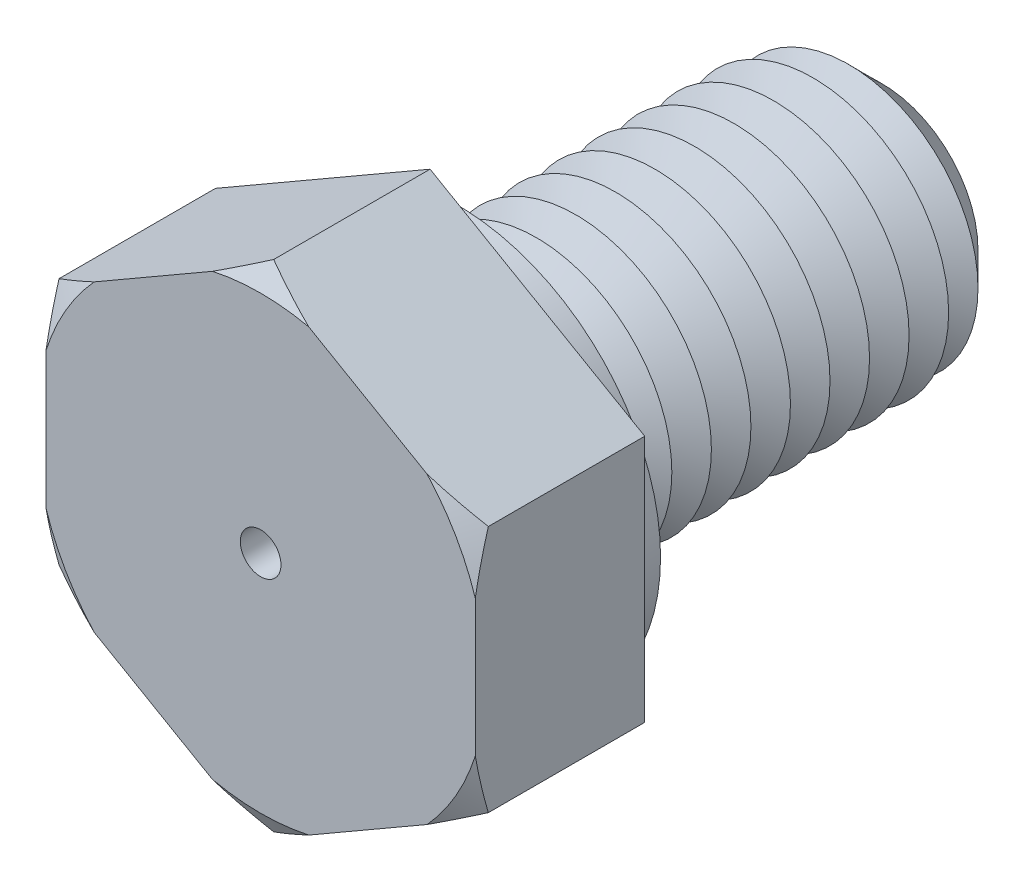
ISO-10303-21;
HEADER;
FILE_DESCRIPTION(('STEP AP214'),'2;1');
FILE_NAME('part.step','',(''),(''),'','','');
FILE_SCHEMA(('AUTOMOTIVE_DESIGN { 1 0 10303 214 1 1 1 1 }'));
ENDSEC;
DATA;
#1=APPLICATION_CONTEXT('core data for automotive mechanical design processes');
#2=APPLICATION_PROTOCOL_DEFINITION('international standard','automotive_design',2000,#1);
#3=PRODUCT_CONTEXT('',#1,'mechanical');
#4=PRODUCT('Part','Part','',(#3));
#5=PRODUCT_RELATED_PRODUCT_CATEGORY('part','',(#4));
#6=PRODUCT_DEFINITION_FORMATION('','',#4);
#7=PRODUCT_DEFINITION_CONTEXT('part definition',#1,'design');
#8=PRODUCT_DEFINITION('design','',#6,#7);
#9=PRODUCT_DEFINITION_SHAPE('','',#8);
#10=(LENGTH_UNIT() NAMED_UNIT(*) SI_UNIT(.MILLI.,.METRE.));
#11=(NAMED_UNIT(*) PLANE_ANGLE_UNIT() SI_UNIT($,.RADIAN.));
#12=(NAMED_UNIT(*) SI_UNIT($,.STERADIAN.) SOLID_ANGLE_UNIT());
#13=UNCERTAINTY_MEASURE_WITH_UNIT(LENGTH_MEASURE(1.E-05),#10,'distance_accuracy_value','');
#14=(GEOMETRIC_REPRESENTATION_CONTEXT(3) GLOBAL_UNCERTAINTY_ASSIGNED_CONTEXT((#13)) GLOBAL_UNIT_ASSIGNED_CONTEXT((#10,
#11,#12)) REPRESENTATION_CONTEXT('',''));
#15=CARTESIAN_POINT('',(0.,0.,0.));
#16=DIRECTION('',(0.,0.,1.));
#17=DIRECTION('',(1.,0.,0.));
#18=AXIS2_PLACEMENT_3D('',#15,#16,#17);
#19=CARTESIAN_POINT('',(9.5,5.48482755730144,7.5));
#20=DIRECTION('',(-0.5,-0.866025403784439,0.));
#21=DIRECTION('',(0.866025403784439,-0.5,0.));
#22=AXIS2_PLACEMENT_3D('',#19,#20,#21);
#23=PLANE('',#22);
#24=CARTESIAN_POINT('',(16.0911028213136,1.67945256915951,3.91531658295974));
#25=CARTESIAN_POINT('',(15.7926530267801,1.85176263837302,4.07633378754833));
#26=CARTESIAN_POINT('',(15.4934885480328,2.02448533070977,4.23561185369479));
#27=CARTESIAN_POINT('',(14.8934288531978,2.37092995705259,4.54987291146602));
#28=CARTESIAN_POINT('',(14.5925334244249,2.54465201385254,4.70485536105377));
#29=CARTESIAN_POINT('',(13.9878148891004,2.89378642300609,5.01015744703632));
#30=CARTESIAN_POINT('',(13.6839854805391,3.06920241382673,5.16046049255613));
#31=CARTESIAN_POINT('',(13.0740489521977,3.4213494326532,5.45475890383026));
#32=CARTESIAN_POINT('',(12.7679419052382,3.59808041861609,5.59875447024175));
#33=CARTESIAN_POINT('',(12.1452865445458,3.95757065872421,5.88261207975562));
#34=CARTESIAN_POINT('',(11.8286703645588,4.14036909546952,6.02227655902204));
#35=CARTESIAN_POINT('',(11.1922429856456,4.50781061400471,6.29164435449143));
#36=CARTESIAN_POINT('',(10.8724316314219,4.69245378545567,6.42134718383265));
#37=CARTESIAN_POINT('',(10.2295404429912,5.06362718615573,6.66831982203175));
#38=CARTESIAN_POINT('',(9.90646410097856,5.25015539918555,6.78560163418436));
#39=CARTESIAN_POINT('',(9.2565183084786,5.62540177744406,7.00502233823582));
#40=CARTESIAN_POINT('',(8.92964935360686,5.81411965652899,7.1071631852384));
#41=CARTESIAN_POINT('',(8.14786487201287,6.26548313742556,7.32807954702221));
#42=CARTESIAN_POINT('',(7.6911273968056,6.52918064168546,7.43861218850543));
#43=CARTESIAN_POINT('',(7.00135730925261,6.92741958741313,7.57140056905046));
#44=CARTESIAN_POINT('',(6.77066782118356,7.06060822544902,7.61016053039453));
#45=CARTESIAN_POINT('',(6.30799755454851,7.3277310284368,7.6757081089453));
#46=CARTESIAN_POINT('',(6.07601678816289,7.46166518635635,7.70249583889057));
#47=CARTESIAN_POINT('',(5.61390562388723,7.72846519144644,7.74308971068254));
#48=CARTESIAN_POINT('',(5.38378495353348,7.86132542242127,7.75704275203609));
#49=CARTESIAN_POINT('',(4.92322735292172,8.1272284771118,7.77208284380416));
#50=CARTESIAN_POINT('',(4.69279042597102,8.26027129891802,7.7731700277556));
#51=CARTESIAN_POINT('',(4.23214422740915,8.52622550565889,7.76244373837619));
#52=CARTESIAN_POINT('',(4.00193495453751,8.65913689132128,7.7506303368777));
#53=CARTESIAN_POINT('',(3.54223236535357,8.92454630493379,7.71446028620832));
#54=CARTESIAN_POINT('',(3.31273916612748,9.05704426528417,7.69010168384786));
#55=CARTESIAN_POINT('',(2.77042202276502,9.37015121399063,7.61833387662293));
#56=CARTESIAN_POINT('',(2.45810922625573,9.55046509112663,7.56573497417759));
#57=CARTESIAN_POINT('',(1.83647686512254,9.90936470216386,7.44074774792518));
#58=CARTESIAN_POINT('',(1.52715774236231,10.087950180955,7.36835654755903));
#59=CARTESIAN_POINT('',(0.911549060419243,10.4433720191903,7.20651778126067));
#60=CARTESIAN_POINT('',(0.605263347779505,10.6202061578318,7.1170509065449));
#61=CARTESIAN_POINT('',(-0.00386858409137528,10.9718886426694,6.92387899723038));
#62=CARTESIAN_POINT('',(-0.30671501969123,11.1467371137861,6.8201748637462));
#63=CARTESIAN_POINT('',(-0.912759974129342,11.496637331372,6.59968787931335));
#64=CARTESIAN_POINT('',(-1.21591973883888,11.6716667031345,6.48276398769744));
#65=CARTESIAN_POINT('',(-1.8190277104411,12.0198712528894,6.23911056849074));
#66=CARTESIAN_POINT('',(-2.11897790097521,12.1930475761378,6.11238754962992));
#67=CARTESIAN_POINT('',(-2.71614501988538,12.5378221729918,5.85087494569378));
#68=CARTESIAN_POINT('',(-3.01336251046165,12.7094207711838,5.71608706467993));
#69=CARTESIAN_POINT('',(-3.60546807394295,13.0512730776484,5.43985672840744));
#70=CARTESIAN_POINT('',(-3.90035610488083,13.2215267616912,5.29841415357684));
#71=CARTESIAN_POINT('',(-4.39671248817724,13.5080982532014,5.05486951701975));
#72=CARTESIAN_POINT('',(-4.59871463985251,13.624724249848,4.95421186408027));
#73=CARTESIAN_POINT('',(-5.00183994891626,13.8574687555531,4.75059724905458));
#74=CARTESIAN_POINT('',(-5.20296313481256,13.9735872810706,4.647640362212));
#75=CARTESIAN_POINT('',(-5.60231741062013,14.2041545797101,4.44078592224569));
#76=CARTESIAN_POINT('',(-5.80055672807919,14.3186081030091,4.33690951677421));
#77=CARTESIAN_POINT('',(-6.19633679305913,14.5471118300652,4.12738601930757));
#78=CARTESIAN_POINT('',(-6.39387752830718,14.6611620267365,4.02173889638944));
#79=CARTESIAN_POINT('',(-6.59110282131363,14.7750301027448,3.91531658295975));
#80=B_SPLINE_CURVE_WITH_KNOTS('',3,(#24,#25,#26,#27,#28,#29,#30,#31,#32,#33,#34,#35,#36,#37,#38,
#39,#40,#41,#42,#43,#44,#45,#46,#47,#48,#49,#50,#51,#52,#53,#54,#55,#56,#57,#58,#59,#60,#61,#62,
#63,#64,#65,#66,#67,#68,#69,#70,#71,#72,#73,#74,#75,#76,#77,#78,#79),.UNSPECIFIED.,.F.,.F.,(4,2,
2,2,2,2,2,2,2,2,2,2,2,2,2,2,2,2,2,2,2,2,2,2,2,2,2,4),(0.,1.14115474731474,2.28245284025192,
3.42741980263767,4.57235031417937,5.74632926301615,6.92036555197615,8.09325673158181,
9.26599632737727,10.8807998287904,11.6881240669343,12.4954407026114,13.2933978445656,
14.0913467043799,14.8892911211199,15.6873598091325,16.7800286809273,17.8728564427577,
18.9669273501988,20.0609290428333,21.1679585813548,22.2742590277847,23.380326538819,
24.4864139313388,25.2485345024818,26.010630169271,26.7647435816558,27.5188701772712),.UNSPECIFIED.);
#81=CARTESIAN_POINT('',(9.5,5.48482755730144,6.92264973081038));
#82=VERTEX_POINT('',#81);
#83=CARTESIAN_POINT('',(7.36878164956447,6.71528704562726,7.5));
#84=VERTEX_POINT('',#83);
#85=EDGE_CURVE('E132',#82,#84,#80,.T.);
#86=ORIENTED_EDGE('',*,*,#85,.F.);
#87=DIRECTION('',(0.,0.,-1.));
#88=VECTOR('',#87,1.);
#89=CARTESIAN_POINT('',(9.5,5.48482755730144,7.5));
#90=LINE('',#89,#88);
#91=CARTESIAN_POINT('',(9.5,5.48482755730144,0.));
#92=VERTEX_POINT('',#91);
#93=EDGE_CURVE('E144',#82,#92,#90,.T.);
#94=ORIENTED_EDGE('',*,*,#93,.T.);
#95=DIRECTION('',(-0.866025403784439,0.5,0.));
#96=VECTOR('',#95,1.);
#97=CARTESIAN_POINT('',(9.5,5.48482755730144,0.));
#98=LINE('',#97,#96);
#99=CARTESIAN_POINT('',(0.,10.9696551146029,0.));
#100=VERTEX_POINT('',#99);
#101=EDGE_CURVE('E283',#92,#100,#98,.T.);
#102=ORIENTED_EDGE('',*,*,#101,.T.);
#103=DIRECTION('',(0.,0.,-1.));
#104=VECTOR('',#103,1.);
#105=CARTESIAN_POINT('',(0.,10.9696551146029,7.5));
#106=LINE('',#105,#104);
#107=CARTESIAN_POINT('',(0.,10.9696551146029,6.92264973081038));
#108=VERTEX_POINT('',#107);
#109=EDGE_CURVE('E179',#108,#100,#106,.T.);
#110=ORIENTED_EDGE('',*,*,#109,.F.);
#111=CARTESIAN_POINT('',(2.13121835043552,9.73919562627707,7.5));
#112=VERTEX_POINT('',#111);
#113=EDGE_CURVE('E151',#112,#108,#80,.T.);
#114=ORIENTED_EDGE('',*,*,#113,.F.);
#115=DIRECTION('',(-0.866025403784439,0.5,0.));
#116=VECTOR('',#115,1.);
#117=CARTESIAN_POINT('',(9.5,5.48482755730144,7.5));
#118=LINE('',#117,#116);
#119=EDGE_CURVE('E148',#84,#112,#118,.T.);
#120=ORIENTED_EDGE('',*,*,#119,.F.);
#121=EDGE_LOOP('',(#86,#94,#102,#110,#114,#120));
#122=FACE_BOUND('',#121,.T.);
#123=ADVANCED_FACE('F39',(#122),#23,.F.);
#124=CARTESIAN_POINT('',(0.,10.9696551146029,7.5));
#125=DIRECTION('',(0.5,-0.866025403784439,0.));
#126=DIRECTION('',(0.866025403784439,0.5,0.));
#127=AXIS2_PLACEMENT_3D('',#124,#125,#126);
#128=PLANE('',#127);
#129=CARTESIAN_POINT('',(6.59110282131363,14.7750301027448,3.91531658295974));
#130=CARTESIAN_POINT('',(6.29265302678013,14.6027200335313,4.07633378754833));
#131=CARTESIAN_POINT('',(5.99348854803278,14.4299973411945,4.23561185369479));
#132=CARTESIAN_POINT('',(5.3934288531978,14.0835527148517,4.54987291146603));
#133=CARTESIAN_POINT('',(5.09253342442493,13.9098306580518,4.70485536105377));
#134=CARTESIAN_POINT('',(4.48781488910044,13.5606962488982,5.01015744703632));
#135=CARTESIAN_POINT('',(4.18398548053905,13.3852802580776,5.16046049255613));
#136=CARTESIAN_POINT('',(3.5740489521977,13.0331332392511,5.45475890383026));
#137=CARTESIAN_POINT('',(3.26794190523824,12.8564022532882,5.59875447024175));
#138=CARTESIAN_POINT('',(2.64528654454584,12.4969120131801,5.88261207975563));
#139=CARTESIAN_POINT('',(2.32867036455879,12.3141135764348,6.02227655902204));
#140=CARTESIAN_POINT('',(1.69224298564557,11.9466720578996,6.29164435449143));
#141=CARTESIAN_POINT('',(1.37243163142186,11.7620288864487,6.42134718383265));
#142=CARTESIAN_POINT('',(0.729540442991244,11.3908554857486,6.66831982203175));
#143=CARTESIAN_POINT('',(0.406464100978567,11.2043272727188,6.78560163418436));
#144=CARTESIAN_POINT('',(-0.243481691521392,10.8290808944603,7.00502233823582));
#145=CARTESIAN_POINT('',(-0.570350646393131,10.6403630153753,7.1071631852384));
#146=CARTESIAN_POINT('',(-1.35213512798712,10.1889995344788,7.32807954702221));
#147=CARTESIAN_POINT('',(-1.80887260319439,9.92530203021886,7.43861218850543));
#148=CARTESIAN_POINT('',(-2.49864269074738,9.52706308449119,7.57140056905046));
#149=CARTESIAN_POINT('',(-2.72933217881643,9.39387444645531,7.61016053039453));
#150=CARTESIAN_POINT('',(-3.19200244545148,9.12675164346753,7.6757081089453));
#151=CARTESIAN_POINT('',(-3.4239832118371,8.99281748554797,7.70249583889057));
#152=CARTESIAN_POINT('',(-3.88609437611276,8.72601748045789,7.74308971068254));
#153=CARTESIAN_POINT('',(-4.11621504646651,8.59315724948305,7.75704275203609));
#154=CARTESIAN_POINT('',(-4.57677264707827,8.32725419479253,7.77208284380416));
#155=CARTESIAN_POINT('',(-4.80720957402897,8.19421137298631,7.7731700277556));
#156=CARTESIAN_POINT('',(-5.26785577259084,7.92825716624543,7.76244373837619));
#157=CARTESIAN_POINT('',(-5.49806504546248,7.79534578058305,7.7506303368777));
#158=CARTESIAN_POINT('',(-5.95776763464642,7.52993636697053,7.71446028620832));
#159=CARTESIAN_POINT('',(-6.18726083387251,7.39743840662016,7.69010168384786));
#160=CARTESIAN_POINT('',(-6.72957797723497,7.0843314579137,7.61833387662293));
#161=CARTESIAN_POINT('',(-7.04189077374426,6.90401758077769,7.56573497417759));
#162=CARTESIAN_POINT('',(-7.66352313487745,6.54511796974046,7.44074774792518));
#163=CARTESIAN_POINT('',(-7.97284225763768,6.36653249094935,7.36835654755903));
#164=CARTESIAN_POINT('',(-8.58845093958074,6.01111065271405,7.20651778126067));
#165=CARTESIAN_POINT('',(-8.89473665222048,5.83427651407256,7.1170509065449));
#166=CARTESIAN_POINT('',(-9.50386858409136,5.48259402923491,6.92387899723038));
#167=CARTESIAN_POINT('',(-9.80671501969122,5.30774555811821,6.8201748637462));
#168=CARTESIAN_POINT('',(-10.4127599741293,4.95784534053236,6.59968787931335));
#169=CARTESIAN_POINT('',(-10.7159197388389,4.78281596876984,6.48276398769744));
#170=CARTESIAN_POINT('',(-11.3190277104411,4.43461141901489,6.23911056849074));
#171=CARTESIAN_POINT('',(-11.6189779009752,4.26143509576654,6.11238754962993));
#172=CARTESIAN_POINT('',(-12.2161450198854,3.91666049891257,5.85087494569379));
#173=CARTESIAN_POINT('',(-12.5133625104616,3.74506190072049,5.71608706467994));
#174=CARTESIAN_POINT('',(-13.1054680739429,3.40320959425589,5.43985672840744));
#175=CARTESIAN_POINT('',(-13.4003561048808,3.2329559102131,5.29841415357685));
#176=CARTESIAN_POINT('',(-13.8967124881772,2.94638441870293,5.05486951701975));
#177=CARTESIAN_POINT('',(-14.0987146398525,2.82975842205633,4.95421186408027));
#178=CARTESIAN_POINT('',(-14.5018399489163,2.59701391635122,4.75059724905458));
#179=CARTESIAN_POINT('',(-14.7029631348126,2.48089539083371,4.647640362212));
#180=CARTESIAN_POINT('',(-15.1023174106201,2.25032809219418,4.44078592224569));
#181=CARTESIAN_POINT('',(-15.3005567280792,2.13587456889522,4.33690951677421));
#182=CARTESIAN_POINT('',(-15.6963367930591,1.90737084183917,4.12738601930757));
#183=CARTESIAN_POINT('',(-15.8938775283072,1.79332064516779,4.02173889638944));
#184=CARTESIAN_POINT('',(-16.0911028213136,1.67945256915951,3.91531658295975));
#185=B_SPLINE_CURVE_WITH_KNOTS('',3,(#129,#130,#131,#132,#133,#134,#135,#136,#137,#138,#139,
#140,#141,#142,#143,#144,#145,#146,#147,#148,#149,#150,#151,#152,#153,#154,#155,#156,#157,#158,
#159,#160,#161,#162,#163,#164,#165,#166,#167,#168,#169,#170,#171,#172,#173,#174,#175,#176,#177,
#178,#179,#180,#181,#182,#183,#184),.UNSPECIFIED.,.F.,.F.,(4,2,2,2,2,2,2,2,2,2,2,2,2,2,2,2,2,2,
2,2,2,2,2,2,2,2,2,4),(0.,1.14115474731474,2.28245284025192,3.42741980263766,4.57235031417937,
5.74632926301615,6.92036555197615,8.09325673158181,9.26599632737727,10.8807998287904,
11.6881240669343,12.4954407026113,13.2933978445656,14.0913467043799,14.8892911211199,
15.6873598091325,16.7800286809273,17.8728564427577,18.9669273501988,20.0609290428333,
21.1679585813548,22.2742590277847,23.380326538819,24.4864139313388,25.2485345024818,
26.010630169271,26.7647435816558,27.5188701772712),.UNSPECIFIED.);
#186=CARTESIAN_POINT('',(-2.13121835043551,9.73919562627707,7.5));
#187=VERTEX_POINT('',#186);
#188=EDGE_CURVE('E325',#108,#187,#185,.T.);
#189=ORIENTED_EDGE('',*,*,#188,.F.);
#190=ORIENTED_EDGE('',*,*,#109,.T.);
#191=DIRECTION('',(-0.866025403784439,-0.5,0.));
#192=VECTOR('',#191,1.);
#193=CARTESIAN_POINT('',(0.,10.9696551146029,0.));
#194=LINE('',#193,#192);
#195=CARTESIAN_POINT('',(-9.5,5.48482755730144,0.));
#196=VERTEX_POINT('',#195);
#197=EDGE_CURVE('E302',#100,#196,#194,.T.);
#198=ORIENTED_EDGE('',*,*,#197,.T.);
#199=DIRECTION('',(0.,0.,-1.));
#200=VECTOR('',#199,1.);
#201=CARTESIAN_POINT('',(-9.5,5.48482755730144,7.5));
#202=LINE('',#201,#200);
#203=CARTESIAN_POINT('',(-9.5,5.48482755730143,6.92264973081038));
#204=VERTEX_POINT('',#203);
#205=EDGE_CURVE('E176',#204,#196,#202,.T.);
#206=ORIENTED_EDGE('',*,*,#205,.F.);
#207=CARTESIAN_POINT('',(-7.36878164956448,6.71528704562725,7.5));
#208=VERTEX_POINT('',#207);
#209=EDGE_CURVE('E324',#208,#204,#185,.T.);
#210=ORIENTED_EDGE('',*,*,#209,.F.);
#211=DIRECTION('',(-0.866025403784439,-0.5,0.));
#212=VECTOR('',#211,1.);
#213=CARTESIAN_POINT('',(0.,10.9696551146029,7.5));
#214=LINE('',#213,#212);
#215=EDGE_CURVE('E286',#187,#208,#214,.T.);
#216=ORIENTED_EDGE('',*,*,#215,.F.);
#217=EDGE_LOOP('',(#189,#190,#198,#206,#210,#216));
#218=FACE_BOUND('',#217,.T.);
#219=ADVANCED_FACE('F387',(#218),#128,.F.);
#220=CARTESIAN_POINT('',(-9.5,5.48482755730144,7.5));
#221=DIRECTION('',(1.,0.,0.));
#222=DIRECTION('',(0.,1.,0.));
#223=AXIS2_PLACEMENT_3D('',#220,#221,#222);
#224=PLANE('',#223);
#225=CARTESIAN_POINT('',(-9.5,12.0759303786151,4.38509256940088));
#226=CARTESIAN_POINT('',(-9.5,11.7327439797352,4.5407773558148));
#227=CARTESIAN_POINT('',(-9.5,11.388618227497,4.69443095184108));
#228=CARTESIAN_POINT('',(-9.5,10.698085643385,4.99669009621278));
#229=CARTESIAN_POINT('',(-9.5,10.3516784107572,5.1452947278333));
#230=CARTESIAN_POINT('',(-9.5,9.65484997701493,5.43702212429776));
#231=CARTESIAN_POINT('',(-9.5,9.30441804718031,5.58011936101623));
#232=CARTESIAN_POINT('',(-9.5,8.60059023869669,5.85880989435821));
#233=CARTESIAN_POINT('',(-9.5,8.24719449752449,5.9944035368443));
#234=CARTESIAN_POINT('',(-9.5,7.53860340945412,6.25582574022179));
#235=CARTESIAN_POINT('',(-9.5,7.18342337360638,6.38169559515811));
#236=CARTESIAN_POINT('',(-9.5,6.46926569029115,6.62229858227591));
#237=CARTESIAN_POINT('',(-9.5,6.11028785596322,6.73703116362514));
#238=CARTESIAN_POINT('',(-9.5,5.38872372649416,6.95272419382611));
#239=CARTESIAN_POINT('',(-9.5,5.02614305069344,7.05370330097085));
#240=CARTESIAN_POINT('',(-9.5,4.29675196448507,7.23920160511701));
#241=CARTESIAN_POINT('',(-9.5,3.92994173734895,7.32372151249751));
#242=CARTESIAN_POINT('',(-9.5,3.29665308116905,7.45205940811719));
#243=CARTESIAN_POINT('',(-9.5,3.03113701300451,7.50062833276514));
#244=CARTESIAN_POINT('',(-9.5,2.49832809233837,7.5865841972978));
#245=CARTESIAN_POINT('',(-9.5,2.23103554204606,7.62397299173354));
#246=CARTESIAN_POINT('',(-9.5,1.69506861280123,7.68659004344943));
#247=CARTESIAN_POINT('',(-9.5,1.42639449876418,7.71182055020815));
#248=CARTESIAN_POINT('',(-9.5,0.888138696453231,7.74939803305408));
#249=CARTESIAN_POINT('',(-9.5,0.618557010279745,7.76174503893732));
#250=CARTESIAN_POINT('',(-9.5,0.0792458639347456,7.77317034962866));
#251=CARTESIAN_POINT('',(-9.5,-0.190483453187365,7.77225534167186));
#252=CARTESIAN_POINT('',(-9.5,-0.729567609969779,7.75720205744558));
#253=CARTESIAN_POINT('',(-9.5,-0.998922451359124,7.74306384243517));
#254=CARTESIAN_POINT('',(-9.5,-1.53667618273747,7.70199575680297));
#255=CARTESIAN_POINT('',(-9.5,-1.80507496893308,7.67506453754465));
#256=CARTESIAN_POINT('',(-9.5,-2.34038611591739,7.60918517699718));
#257=CARTESIAN_POINT('',(-9.5,-2.60729841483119,7.57023653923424));
#258=CARTESIAN_POINT('',(-9.5,-3.27166409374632,7.45918941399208));
#259=CARTESIAN_POINT('',(-9.5,-3.66797754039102,7.38023980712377));
#260=CARTESIAN_POINT('',(-9.5,-4.45585575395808,7.20141943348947));
#261=CARTESIAN_POINT('',(-9.5,-4.8474194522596,7.10154404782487));
#262=CARTESIAN_POINT('',(-9.5,-5.6265713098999,6.88438943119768));
#263=CARTESIAN_POINT('',(-9.5,-6.01414884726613,6.76707245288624));
#264=CARTESIAN_POINT('',(-9.5,-6.78474185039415,6.51851091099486));
#265=CARTESIAN_POINT('',(-9.5,-7.16775763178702,6.38726731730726));
#266=CARTESIAN_POINT('',(-9.5,-7.93407213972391,6.11202298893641));
#267=CARTESIAN_POINT('',(-9.5,-8.31732458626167,5.96789419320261));
#268=CARTESIAN_POINT('',(-9.5,-9.08024927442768,5.67043108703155));
#269=CARTESIAN_POINT('',(-9.5,-9.4599212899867,5.51709619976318));
#270=CARTESIAN_POINT('',(-9.5,-10.2138362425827,5.20397874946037));
#271=CARTESIAN_POINT('',(-9.5,-10.5880982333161,5.04424191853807));
#272=CARTESIAN_POINT('',(-9.5,-11.1474871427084,4.80018423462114));
#273=CARTESIAN_POINT('',(-9.5,-11.3335947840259,4.71809930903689));
#274=CARTESIAN_POINT('',(-9.5,-11.7052038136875,4.55257683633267));
#275=CARTESIAN_POINT('',(-9.5,-11.8907052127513,4.46913931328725));
#276=CARTESIAN_POINT('',(-9.5,-12.0759303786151,4.38509256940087));
#277=B_SPLINE_CURVE_WITH_KNOTS('',3,(#225,#226,#227,#228,#229,#230,#231,#232,#233,#234,#235,
#236,#237,#238,#239,#240,#241,#242,#243,#244,#245,#246,#247,#248,#249,#250,#251,#252,#253,#254,
#255,#256,#257,#258,#259,#260,#261,#262,#263,#264,#265,#266,#267,#268,#269,#270,#271,#272,#273,
#274,#275,#276),.UNSPECIFIED.,.F.,.F.,(4,2,2,2,2,2,2,2,2,2,2,2,2,2,2,2,2,2,2,2,2,2,2,2,2,4),(0.,
1.13056270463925,2.26132959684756,3.39682602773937,4.53227007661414,5.66259174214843,
6.79296928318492,7.92179771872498,9.0505774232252,9.86013572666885,10.6695596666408,
11.4788337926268,12.288106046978,13.0969702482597,13.9058307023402,14.7147764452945,
15.5237556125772,16.7353316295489,17.9471753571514,19.1616810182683,20.3761021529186,
21.6043286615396,22.8326322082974,24.0533405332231,24.6635541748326,25.273756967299),.UNSPECIFIED.);
#278=CARTESIAN_POINT('',(-9.5,3.02390858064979,7.5));
#279=VERTEX_POINT('',#278);
#280=EDGE_CURVE('E326',#204,#279,#277,.T.);
#281=ORIENTED_EDGE('',*,*,#280,.F.);
#282=ORIENTED_EDGE('',*,*,#205,.T.);
#283=DIRECTION('',(0.,-1.,0.));
#284=VECTOR('',#283,1.);
#285=CARTESIAN_POINT('',(-9.5,5.48482755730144,0.));
#286=LINE('',#285,#284);
#287=CARTESIAN_POINT('',(-9.5,-5.48482755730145,0.));
#288=VERTEX_POINT('',#287);
#289=EDGE_CURVE('E306',#196,#288,#286,.T.);
#290=ORIENTED_EDGE('',*,*,#289,.T.);
#291=DIRECTION('',(0.,0.,-1.));
#292=VECTOR('',#291,1.);
#293=CARTESIAN_POINT('',(-9.5,-5.48482755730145,7.5));
#294=LINE('',#293,#292);
#295=CARTESIAN_POINT('',(-9.49999999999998,-5.48482755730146,6.92264973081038));
#296=VERTEX_POINT('',#295);
#297=EDGE_CURVE('E173',#296,#288,#294,.T.);
#298=ORIENTED_EDGE('',*,*,#297,.F.);
#299=CARTESIAN_POINT('',(-9.5,-3.02390858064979,7.5));
#300=VERTEX_POINT('',#299);
#301=EDGE_CURVE('E372',#300,#296,#277,.T.);
#302=ORIENTED_EDGE('',*,*,#301,.F.);
#303=DIRECTION('',(0.,-1.,0.));
#304=VECTOR('',#303,1.);
#305=CARTESIAN_POINT('',(-9.5,5.48482755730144,7.5));
#306=LINE('',#305,#304);
#307=EDGE_CURVE('E289',#279,#300,#306,.T.);
#308=ORIENTED_EDGE('',*,*,#307,.F.);
#309=EDGE_LOOP('',(#281,#282,#290,#298,#302,#308));
#310=FACE_BOUND('',#309,.T.);
#311=ADVANCED_FACE('F383',(#310),#224,.F.);
#312=CARTESIAN_POINT('',(-9.5,-5.48482755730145,7.5));
#313=DIRECTION('',(0.5,0.866025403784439,0.));
#314=DIRECTION('',(-0.866025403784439,0.5,0.));
#315=AXIS2_PLACEMENT_3D('',#312,#313,#314);
#316=PLANE('',#315);
#317=CARTESIAN_POINT('',(-16.0911028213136,-1.67945256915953,3.91531658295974));
#318=CARTESIAN_POINT('',(-15.7926530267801,-1.85176263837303,4.07633378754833));
#319=CARTESIAN_POINT('',(-15.4934885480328,-2.02448533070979,4.23561185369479));
#320=CARTESIAN_POINT('',(-14.8934288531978,-2.37092995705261,4.54987291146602));
#321=CARTESIAN_POINT('',(-14.5925334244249,-2.54465201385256,4.70485536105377));
#322=CARTESIAN_POINT('',(-13.9878148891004,-2.89378642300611,5.01015744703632));
#323=CARTESIAN_POINT('',(-13.683985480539,-3.06920241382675,5.16046049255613));
#324=CARTESIAN_POINT('',(-13.0740489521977,-3.42134943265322,5.45475890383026));
#325=CARTESIAN_POINT('',(-12.7679419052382,-3.5980804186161,5.59875447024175));
#326=CARTESIAN_POINT('',(-12.1452865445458,-3.95757065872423,5.88261207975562));
#327=CARTESIAN_POINT('',(-11.8286703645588,-4.14036909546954,6.02227655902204));
#328=CARTESIAN_POINT('',(-11.1922429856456,-4.50781061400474,6.29164435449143));
#329=CARTESIAN_POINT('',(-10.8724316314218,-4.69245378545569,6.42134718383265));
#330=CARTESIAN_POINT('',(-10.2295404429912,-5.06362718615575,6.66831982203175));
#331=CARTESIAN_POINT('',(-9.90646410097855,-5.25015539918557,6.78560163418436));
#332=CARTESIAN_POINT('',(-9.25651830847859,-5.62540177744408,7.00502233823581));
#333=CARTESIAN_POINT('',(-8.92964935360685,-5.81411965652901,7.1071631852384));
#334=CARTESIAN_POINT('',(-8.14786487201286,-6.26548313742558,7.32807954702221));
#335=CARTESIAN_POINT('',(-7.69112739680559,-6.52918064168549,7.43861218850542));
#336=CARTESIAN_POINT('',(-7.0013573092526,-6.92741958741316,7.57140056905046));
#337=CARTESIAN_POINT('',(-6.77066782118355,-7.06060822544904,7.61016053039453));
#338=CARTESIAN_POINT('',(-6.3079975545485,-7.32773102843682,7.6757081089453));
#339=CARTESIAN_POINT('',(-6.07601678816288,-7.46166518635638,7.70249583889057));
#340=CARTESIAN_POINT('',(-5.61390562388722,-7.72846519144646,7.74308971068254));
#341=CARTESIAN_POINT('',(-5.38378495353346,-7.8613254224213,7.75704275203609));
#342=CARTESIAN_POINT('',(-4.9232273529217,-8.12722847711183,7.77208284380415));
#343=CARTESIAN_POINT('',(-4.692790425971,-8.26027129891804,7.77317002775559));
#344=CARTESIAN_POINT('',(-4.23214422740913,-8.52622550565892,7.76244373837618));
#345=CARTESIAN_POINT('',(-4.00193495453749,-8.6591368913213,7.75063033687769));
#346=CARTESIAN_POINT('',(-3.54223236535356,-8.92454630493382,7.71446028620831));
#347=CARTESIAN_POINT('',(-3.31273916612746,-9.05704426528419,7.69010168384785));
#348=CARTESIAN_POINT('',(-2.770422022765,-9.37015121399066,7.61833387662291));
#349=CARTESIAN_POINT('',(-2.45810922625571,-9.55046509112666,7.56573497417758));
#350=CARTESIAN_POINT('',(-1.83647686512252,-9.9093647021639,7.44074774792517));
#351=CARTESIAN_POINT('',(-1.52715774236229,-10.087950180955,7.36835654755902));
#352=CARTESIAN_POINT('',(-0.911549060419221,-10.4433720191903,7.20651778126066));
#353=CARTESIAN_POINT('',(-0.605263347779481,-10.6202061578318,7.11705090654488));
#354=CARTESIAN_POINT('',(0.00386858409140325,-10.9718886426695,6.92387899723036));
#355=CARTESIAN_POINT('',(0.30671501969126,-11.1467371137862,6.82017486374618));
#356=CARTESIAN_POINT('',(0.912759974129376,-11.496637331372,6.59968787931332));
#357=CARTESIAN_POINT('',(1.21591973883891,-11.6716667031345,6.48276398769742));
#358=CARTESIAN_POINT('',(1.81902771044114,-12.0198712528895,6.23911056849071));
#359=CARTESIAN_POINT('',(2.11897790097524,-12.1930475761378,6.11238754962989));
#360=CARTESIAN_POINT('',(2.71614501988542,-12.5378221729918,5.85087494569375));
#361=CARTESIAN_POINT('',(3.01336251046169,-12.7094207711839,5.7160870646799));
#362=CARTESIAN_POINT('',(3.60546807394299,-13.0512730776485,5.4398567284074));
#363=CARTESIAN_POINT('',(3.90035610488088,-13.2215267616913,5.29841415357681));
#364=CARTESIAN_POINT('',(4.39671248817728,-13.5080982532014,5.05486951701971));
#365=CARTESIAN_POINT('',(4.59871463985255,-13.624724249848,4.95421186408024));
#366=CARTESIAN_POINT('',(5.00183994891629,-13.8574687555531,4.75059724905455));
#367=CARTESIAN_POINT('',(5.20296313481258,-13.9735872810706,4.64764036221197));
#368=CARTESIAN_POINT('',(5.60231741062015,-14.2041545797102,4.44078592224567));
#369=CARTESIAN_POINT('',(5.8005567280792,-14.3186081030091,4.33690951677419));
#370=CARTESIAN_POINT('',(6.19633679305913,-14.5471118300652,4.12738601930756));
#371=CARTESIAN_POINT('',(6.39387752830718,-14.6611620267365,4.02173889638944));
#372=CARTESIAN_POINT('',(6.59110282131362,-14.7750301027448,3.91531658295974));
#373=B_SPLINE_CURVE_WITH_KNOTS('',3,(#317,#318,#319,#320,#321,#322,#323,#324,#325,#326,#327,
#328,#329,#330,#331,#332,#333,#334,#335,#336,#337,#338,#339,#340,#341,#342,#343,#344,#345,#346,
#347,#348,#349,#350,#351,#352,#353,#354,#355,#356,#357,#358,#359,#360,#361,#362,#363,#364,#365,
#366,#367,#368,#369,#370,#371,#372),.UNSPECIFIED.,.F.,.F.,(4,2,2,2,2,2,2,2,2,2,2,2,2,2,2,2,2,2,
2,2,2,2,2,2,2,2,2,4),(0.,1.14115474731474,2.28245284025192,3.42741980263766,4.57235031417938,
5.74632926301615,6.92036555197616,8.09325673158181,9.26599632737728,10.8807998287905,
11.6881240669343,12.4954407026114,13.2933978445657,14.0913467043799,14.8892911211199,
15.6873598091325,16.7800286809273,17.8728564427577,18.9669273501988,20.0609290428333,
21.1679585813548,22.2742590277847,23.3803265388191,24.4864139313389,25.2485345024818,
26.010630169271,26.7647435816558,27.5188701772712),.UNSPECIFIED.);
#374=CARTESIAN_POINT('',(-7.36878164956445,-6.71528704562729,7.5));
#375=VERTEX_POINT('',#374);
#376=EDGE_CURVE('E378',#296,#375,#373,.T.);
#377=ORIENTED_EDGE('',*,*,#376,.F.);
#378=ORIENTED_EDGE('',*,*,#297,.T.);
#379=DIRECTION('',(0.866025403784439,-0.5,0.));
#380=VECTOR('',#379,1.);
#381=CARTESIAN_POINT('',(-9.5,-5.48482755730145,0.));
#382=LINE('',#381,#380);
#383=CARTESIAN_POINT('',(0.,-10.9696551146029,0.));
#384=VERTEX_POINT('',#383);
#385=EDGE_CURVE('E310',#288,#384,#382,.T.);
#386=ORIENTED_EDGE('',*,*,#385,.T.);
#387=DIRECTION('',(0.,0.,-1.));
#388=VECTOR('',#387,1.);
#389=CARTESIAN_POINT('',(0.,-10.9696551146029,7.5));
#390=LINE('',#389,#388);
#391=CARTESIAN_POINT('',(0.,-10.9696551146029,6.92264973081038));
#392=VERTEX_POINT('',#391);
#393=EDGE_CURVE('E163',#392,#384,#390,.T.);
#394=ORIENTED_EDGE('',*,*,#393,.F.);
#395=CARTESIAN_POINT('',(-2.13121835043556,-9.73919562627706,7.5));
#396=VERTEX_POINT('',#395);
#397=EDGE_CURVE('E336',#396,#392,#373,.T.);
#398=ORIENTED_EDGE('',*,*,#397,.F.);
#399=DIRECTION('',(0.866025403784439,-0.5,0.));
#400=VECTOR('',#399,1.);
#401=CARTESIAN_POINT('',(-9.5,-5.48482755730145,7.5));
#402=LINE('',#401,#400);
#403=EDGE_CURVE('E293',#375,#396,#402,.T.);
#404=ORIENTED_EDGE('',*,*,#403,.F.);
#405=EDGE_LOOP('',(#377,#378,#386,#394,#398,#404));
#406=FACE_BOUND('',#405,.T.);
#407=ADVANCED_FACE('F386',(#406),#316,.F.);
#408=CARTESIAN_POINT('',(0.,-10.9696551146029,7.5));
#409=DIRECTION('',(-0.5,0.866025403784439,0.));
#410=DIRECTION('',(-0.866025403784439,-0.5,0.));
#411=AXIS2_PLACEMENT_3D('',#408,#409,#410);
#412=PLANE('',#411);
#413=CARTESIAN_POINT('',(-6.59110282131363,-14.7750301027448,3.91531658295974));
#414=CARTESIAN_POINT('',(-6.29265302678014,-14.6027200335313,4.07633378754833));
#415=CARTESIAN_POINT('',(-5.99348854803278,-14.4299973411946,4.23561185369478));
#416=CARTESIAN_POINT('',(-5.3934288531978,-14.0835527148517,4.54987291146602));
#417=CARTESIAN_POINT('',(-5.09253342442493,-13.9098306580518,4.70485536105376));
#418=CARTESIAN_POINT('',(-4.48781488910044,-13.5606962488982,5.01015744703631));
#419=CARTESIAN_POINT('',(-4.18398548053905,-13.3852802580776,5.16046049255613));
#420=CARTESIAN_POINT('',(-3.5740489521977,-13.0331332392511,5.45475890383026));
#421=CARTESIAN_POINT('',(-3.26794190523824,-12.8564022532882,5.59875447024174));
#422=CARTESIAN_POINT('',(-2.64528654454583,-12.4969120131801,5.88261207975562));
#423=CARTESIAN_POINT('',(-2.32867036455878,-12.3141135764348,6.02227655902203));
#424=CARTESIAN_POINT('',(-1.69224298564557,-11.9466720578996,6.29164435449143));
#425=CARTESIAN_POINT('',(-1.37243163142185,-11.7620288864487,6.42134718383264));
#426=CARTESIAN_POINT('',(-0.729540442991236,-11.3908554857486,6.66831982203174));
#427=CARTESIAN_POINT('',(-0.406464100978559,-11.2043272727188,6.78560163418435));
#428=CARTESIAN_POINT('',(0.243481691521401,-10.8290808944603,7.00502233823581));
#429=CARTESIAN_POINT('',(0.570350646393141,-10.6403630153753,7.10716318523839));
#430=CARTESIAN_POINT('',(1.35213512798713,-10.1889995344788,7.3280795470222));
#431=CARTESIAN_POINT('',(1.8088726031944,-9.92530203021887,7.43861218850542));
#432=CARTESIAN_POINT('',(2.49864269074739,-9.5270630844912,7.57140056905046));
#433=CARTESIAN_POINT('',(2.72933217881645,-9.39387444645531,7.61016053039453));
#434=CARTESIAN_POINT('',(3.19200244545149,-9.12675164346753,7.6757081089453));
#435=CARTESIAN_POINT('',(3.42398321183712,-8.99281748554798,7.70249583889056));
#436=CARTESIAN_POINT('',(3.88609437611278,-8.72601748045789,7.74308971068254));
#437=CARTESIAN_POINT('',(4.11621504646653,-8.59315724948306,7.75704275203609));
#438=CARTESIAN_POINT('',(4.57677264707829,-8.32725419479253,7.77208284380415));
#439=CARTESIAN_POINT('',(4.80720957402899,-8.19421137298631,7.77317002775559));
#440=CARTESIAN_POINT('',(5.26785577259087,-7.92825716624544,7.76244373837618));
#441=CARTESIAN_POINT('',(5.4980650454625,-7.79534578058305,7.75063033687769));
#442=CARTESIAN_POINT('',(5.95776763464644,-7.52993636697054,7.71446028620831));
#443=CARTESIAN_POINT('',(6.18726083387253,-7.39743840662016,7.69010168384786));
#444=CARTESIAN_POINT('',(6.72957797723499,-7.0843314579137,7.61833387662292));
#445=CARTESIAN_POINT('',(7.04189077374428,-6.9040175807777,7.56573497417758));
#446=CARTESIAN_POINT('',(7.66352313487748,-6.54511796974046,7.44074774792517));
#447=CARTESIAN_POINT('',(7.97284225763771,-6.36653249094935,7.36835654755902));
#448=CARTESIAN_POINT('',(8.58845093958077,-6.01111065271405,7.20651778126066));
#449=CARTESIAN_POINT('',(8.89473665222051,-5.83427651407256,7.11705090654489));
#450=CARTESIAN_POINT('',(9.50386858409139,-5.48259402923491,6.92387899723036));
#451=CARTESIAN_POINT('',(9.80671501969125,-5.30774555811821,6.82017486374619));
#452=CARTESIAN_POINT('',(10.4127599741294,-4.95784534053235,6.59968787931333));
#453=CARTESIAN_POINT('',(10.7159197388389,-4.78281596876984,6.48276398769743));
#454=CARTESIAN_POINT('',(11.3190277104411,-4.43461141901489,6.23911056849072));
#455=CARTESIAN_POINT('',(11.6189779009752,-4.26143509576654,6.1123875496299));
#456=CARTESIAN_POINT('',(12.2161450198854,-3.91666049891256,5.85087494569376));
#457=CARTESIAN_POINT('',(12.5133625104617,-3.74506190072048,5.71608706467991));
#458=CARTESIAN_POINT('',(13.105468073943,-3.40320959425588,5.43985672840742));
#459=CARTESIAN_POINT('',(13.4003561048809,-3.23295591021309,5.29841415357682));
#460=CARTESIAN_POINT('',(13.8967124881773,-2.94638441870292,5.05486951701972));
#461=CARTESIAN_POINT('',(14.0987146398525,-2.82975842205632,4.95421186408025));
#462=CARTESIAN_POINT('',(14.5018399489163,-2.59701391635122,4.75059724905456));
#463=CARTESIAN_POINT('',(14.7029631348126,-2.48089539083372,4.64764036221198));
#464=CARTESIAN_POINT('',(15.1023174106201,-2.25032809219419,4.44078592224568));
#465=CARTESIAN_POINT('',(15.3005567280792,-2.13587456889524,4.3369095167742));
#466=CARTESIAN_POINT('',(15.6963367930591,-1.90737084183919,4.12738601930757));
#467=CARTESIAN_POINT('',(15.8938775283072,-1.79332064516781,4.02173889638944));
#468=CARTESIAN_POINT('',(16.0911028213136,-1.67945256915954,3.91531658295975));
#469=B_SPLINE_CURVE_WITH_KNOTS('',3,(#413,#414,#415,#416,#417,#418,#419,#420,#421,#422,#423,
#424,#425,#426,#427,#428,#429,#430,#431,#432,#433,#434,#435,#436,#437,#438,#439,#440,#441,#442,
#443,#444,#445,#446,#447,#448,#449,#450,#451,#452,#453,#454,#455,#456,#457,#458,#459,#460,#461,
#462,#463,#464,#465,#466,#467,#468),.UNSPECIFIED.,.F.,.F.,(4,2,2,2,2,2,2,2,2,2,2,2,2,2,2,2,2,2,
2,2,2,2,2,2,2,2,2,4),(0.,1.14115474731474,2.28245284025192,3.42741980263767,4.57235031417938,
5.74632926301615,6.92036555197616,8.09325673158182,9.26599632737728,10.8807998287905,
11.6881240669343,12.4954407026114,13.2933978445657,14.0913467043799,14.8892911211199,
15.6873598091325,16.7800286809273,17.8728564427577,18.9669273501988,20.0609290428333,
21.1679585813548,22.2742590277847,23.3803265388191,24.4864139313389,25.2485345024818,
26.010630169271,26.7647435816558,27.5188701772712),.UNSPECIFIED.);
#470=CARTESIAN_POINT('',(2.13121835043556,-9.73919562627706,7.5));
#471=VERTEX_POINT('',#470);
#472=EDGE_CURVE('E64',#392,#471,#469,.T.);
#473=ORIENTED_EDGE('',*,*,#472,.F.);
#474=ORIENTED_EDGE('',*,*,#393,.T.);
#475=DIRECTION('',(0.866025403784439,0.5,0.));
#476=VECTOR('',#475,1.);
#477=CARTESIAN_POINT('',(0.,-10.9696551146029,0.));
#478=LINE('',#477,#476);
#479=CARTESIAN_POINT('',(9.5,-5.48482755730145,0.));
#480=VERTEX_POINT('',#479);
#481=EDGE_CURVE('E313',#384,#480,#478,.T.);
#482=ORIENTED_EDGE('',*,*,#481,.T.);
#483=DIRECTION('',(0.,0.,-1.));
#484=VECTOR('',#483,1.);
#485=CARTESIAN_POINT('',(9.5,-5.48482755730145,7.5));
#486=LINE('',#485,#484);
#487=CARTESIAN_POINT('',(9.5,-5.48482755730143,6.92264973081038));
#488=VERTEX_POINT('',#487);
#489=EDGE_CURVE('E157',#488,#480,#486,.T.);
#490=ORIENTED_EDGE('',*,*,#489,.F.);
#491=CARTESIAN_POINT('',(7.36878164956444,-6.71528704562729,7.5));
#492=VERTEX_POINT('',#491);
#493=EDGE_CURVE('E323',#492,#488,#469,.T.);
#494=ORIENTED_EDGE('',*,*,#493,.F.);
#495=DIRECTION('',(0.866025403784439,0.5,0.));
#496=VECTOR('',#495,1.);
#497=CARTESIAN_POINT('',(0.,-10.9696551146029,7.5));
#498=LINE('',#497,#496);
#499=EDGE_CURVE('E166',#471,#492,#498,.T.);
#500=ORIENTED_EDGE('',*,*,#499,.F.);
#501=EDGE_LOOP('',(#473,#474,#482,#490,#494,#500));
#502=FACE_BOUND('',#501,.T.);
#503=ADVANCED_FACE('F351',(#502),#412,.F.);
#504=CARTESIAN_POINT('',(9.5,-5.48482755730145,7.5));
#505=DIRECTION('',(-1.,0.,0.));
#506=DIRECTION('',(0.,-1.,0.));
#507=AXIS2_PLACEMENT_3D('',#504,#505,#506);
#508=PLANE('',#507);
#509=CARTESIAN_POINT('',(9.5,-12.0759303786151,4.38509256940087));
#510=CARTESIAN_POINT('',(9.5,-11.7327439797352,4.54077735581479));
#511=CARTESIAN_POINT('',(9.5,-11.388618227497,4.69443095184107));
#512=CARTESIAN_POINT('',(9.5,-10.698085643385,4.99669009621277));
#513=CARTESIAN_POINT('',(9.5,-10.3516784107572,5.14529472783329));
#514=CARTESIAN_POINT('',(9.5,-9.65484997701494,5.43702212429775));
#515=CARTESIAN_POINT('',(9.5,-9.30441804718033,5.58011936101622));
#516=CARTESIAN_POINT('',(9.5,-8.60059023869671,5.8588098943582));
#517=CARTESIAN_POINT('',(9.5,-8.2471944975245,5.99440353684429));
#518=CARTESIAN_POINT('',(9.5,-7.53860340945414,6.25582574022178));
#519=CARTESIAN_POINT('',(9.5,-7.18342337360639,6.3816955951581));
#520=CARTESIAN_POINT('',(9.5,-6.46926569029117,6.6222985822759));
#521=CARTESIAN_POINT('',(9.5,-6.11028785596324,6.73703116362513));
#522=CARTESIAN_POINT('',(9.5,-5.38872372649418,6.95272419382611));
#523=CARTESIAN_POINT('',(9.5,-5.02614305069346,7.05370330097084));
#524=CARTESIAN_POINT('',(9.5,-4.29675196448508,7.239201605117));
#525=CARTESIAN_POINT('',(9.5,-3.92994173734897,7.32372151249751));
#526=CARTESIAN_POINT('',(9.5,-3.29665308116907,7.45205940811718));
#527=CARTESIAN_POINT('',(9.5,-3.03113701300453,7.50062833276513));
#528=CARTESIAN_POINT('',(9.5,-2.49832809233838,7.5865841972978));
#529=CARTESIAN_POINT('',(9.5,-2.23103554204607,7.62397299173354));
#530=CARTESIAN_POINT('',(9.5,-1.69506861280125,7.68659004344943));
#531=CARTESIAN_POINT('',(9.5,-1.4263944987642,7.71182055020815));
#532=CARTESIAN_POINT('',(9.5,-0.888138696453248,7.74939803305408));
#533=CARTESIAN_POINT('',(9.5,-0.618557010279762,7.76174503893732));
#534=CARTESIAN_POINT('',(9.5,-0.0792458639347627,7.77317034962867));
#535=CARTESIAN_POINT('',(9.5,0.190483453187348,7.77225534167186));
#536=CARTESIAN_POINT('',(9.5,0.729567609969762,7.75720205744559));
#537=CARTESIAN_POINT('',(9.5,0.998922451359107,7.74306384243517));
#538=CARTESIAN_POINT('',(9.5,1.53667618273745,7.70199575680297));
#539=CARTESIAN_POINT('',(9.5,1.80507496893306,7.67506453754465));
#540=CARTESIAN_POINT('',(9.5,2.34038611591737,7.60918517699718));
#541=CARTESIAN_POINT('',(9.5,2.60729841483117,7.57023653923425));
#542=CARTESIAN_POINT('',(9.5,3.2716640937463,7.45918941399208));
#543=CARTESIAN_POINT('',(9.5,3.667977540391,7.38023980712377));
#544=CARTESIAN_POINT('',(9.5,4.45585575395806,7.20141943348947));
#545=CARTESIAN_POINT('',(9.5,4.84741945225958,7.10154404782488));
#546=CARTESIAN_POINT('',(9.5,5.62657130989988,6.88438943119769));
#547=CARTESIAN_POINT('',(9.5,6.01414884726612,6.76707245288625));
#548=CARTESIAN_POINT('',(9.5,6.78474185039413,6.51851091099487));
#549=CARTESIAN_POINT('',(9.5,7.167757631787,6.38726731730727));
#550=CARTESIAN_POINT('',(9.5,7.93407213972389,6.11202298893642));
#551=CARTESIAN_POINT('',(9.5,8.31732458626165,5.96789419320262));
#552=CARTESIAN_POINT('',(9.5,9.08024927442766,5.67043108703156));
#553=CARTESIAN_POINT('',(9.5,9.45992128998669,5.51709619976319));
#554=CARTESIAN_POINT('',(9.5,10.2138362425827,5.20397874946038));
#555=CARTESIAN_POINT('',(9.5,10.5880982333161,5.04424191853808));
#556=CARTESIAN_POINT('',(9.5,11.1474871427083,4.80018423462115));
#557=CARTESIAN_POINT('',(9.5,11.3335947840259,4.7180993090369));
#558=CARTESIAN_POINT('',(9.5,11.7052038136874,4.55257683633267));
#559=CARTESIAN_POINT('',(9.5,11.8907052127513,4.46913931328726));
#560=CARTESIAN_POINT('',(9.5,12.0759303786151,4.38509256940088));
#561=B_SPLINE_CURVE_WITH_KNOTS('',3,(#509,#510,#511,#512,#513,#514,#515,#516,#517,#518,#519,
#520,#521,#522,#523,#524,#525,#526,#527,#528,#529,#530,#531,#532,#533,#534,#535,#536,#537,#538,
#539,#540,#541,#542,#543,#544,#545,#546,#547,#548,#549,#550,#551,#552,#553,#554,#555,#556,#557,
#558,#559,#560),.UNSPECIFIED.,.F.,.F.,(4,2,2,2,2,2,2,2,2,2,2,2,2,2,2,2,2,2,2,2,2,2,2,2,2,4),(0.,
1.13056270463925,2.26132959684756,3.39682602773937,4.53227007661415,5.66259174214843,
6.79296928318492,7.92179771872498,9.0505774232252,9.86013572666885,10.6695596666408,
11.4788337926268,12.288106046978,13.0969702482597,13.9058307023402,14.7147764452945,
15.5237556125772,16.7353316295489,17.9471753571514,19.1616810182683,20.3761021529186,
21.6043286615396,22.8326322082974,24.0533405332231,24.6635541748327,25.273756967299),.UNSPECIFIED.);
#562=CARTESIAN_POINT('',(9.5,-3.0239085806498,7.5));
#563=VERTEX_POINT('',#562);
#564=EDGE_CURVE('E56',#488,#563,#561,.T.);
#565=ORIENTED_EDGE('',*,*,#564,.F.);
#566=ORIENTED_EDGE('',*,*,#489,.T.);
#567=DIRECTION('',(0.,1.,0.));
#568=VECTOR('',#567,1.);
#569=CARTESIAN_POINT('',(9.5,-5.48482755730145,0.));
#570=LINE('',#569,#568);
#571=EDGE_CURVE('E154',#480,#92,#570,.T.);
#572=ORIENTED_EDGE('',*,*,#571,.T.);
#573=ORIENTED_EDGE('',*,*,#93,.F.);
#574=CARTESIAN_POINT('',(9.5,3.0239085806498,7.5));
#575=VERTEX_POINT('',#574);
#576=EDGE_CURVE('E129',#575,#82,#561,.T.);
#577=ORIENTED_EDGE('',*,*,#576,.F.);
#578=DIRECTION('',(0.,1.,0.));
#579=VECTOR('',#578,1.);
#580=CARTESIAN_POINT('',(9.5,-5.48482755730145,7.5));
#581=LINE('',#580,#579);
#582=EDGE_CURVE('E158',#563,#575,#581,.T.);
#583=ORIENTED_EDGE('',*,*,#582,.F.);
#584=EDGE_LOOP('',(#565,#566,#572,#573,#577,#583));
#585=FACE_BOUND('',#584,.T.);
#586=ADVANCED_FACE('F152',(#585),#508,.F.);
#587=CARTESIAN_POINT('',(0.,0.,7.5));
#588=DIRECTION('',(0.,0.,1.));
#589=DIRECTION('',(1.,0.,0.));
#590=AXIS2_PLACEMENT_3D('',#587,#588,#589);
#591=PLANE('',#590);
#592=CARTESIAN_POINT('',(0.,0.,7.5));
#593=DIRECTION('',(0.,0.,1.));
#594=DIRECTION('',(1.,0.,0.));
#595=AXIS2_PLACEMENT_3D('',#592,#593,#594);
#596=CIRCLE('',#595,0.9);
#597=CARTESIAN_POINT('',(0.9,0.,7.5));
#598=VERTEX_POINT('',#597);
#599=EDGE_CURVE('E785',#598,#598,#596,.T.);
#600=ORIENTED_EDGE('',*,*,#599,.F.);
#601=EDGE_LOOP('',(#600));
#602=FACE_BOUND('',#601,.T.);
#603=ORIENTED_EDGE('',*,*,#582,.T.);
#604=CARTESIAN_POINT('',(0.,0.,7.5));
#605=DIRECTION('',(0.,0.,1.));
#606=DIRECTION('',(1.,0.,0.));
#607=AXIS2_PLACEMENT_3D('',#604,#605,#606);
#608=CIRCLE('',#607,9.96965511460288);
#609=EDGE_CURVE('E134',#575,#84,#608,.T.);
#610=ORIENTED_EDGE('',*,*,#609,.T.);
#611=ORIENTED_EDGE('',*,*,#119,.T.);
#612=CARTESIAN_POINT('',(0.,0.,7.5));
#613=DIRECTION('',(0.,0.,1.));
#614=DIRECTION('',(1.,0.,0.));
#615=AXIS2_PLACEMENT_3D('',#612,#613,#614);
#616=CIRCLE('',#615,9.96965511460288);
#617=EDGE_CURVE('E11',#112,#187,#616,.T.);
#618=ORIENTED_EDGE('',*,*,#617,.T.);
#619=ORIENTED_EDGE('',*,*,#215,.T.);
#620=EDGE_CURVE('E49',#208,#279,#616,.T.);
#621=ORIENTED_EDGE('',*,*,#620,.T.);
#622=ORIENTED_EDGE('',*,*,#307,.T.);
#623=EDGE_CURVE('E329',#300,#375,#616,.T.);
#624=ORIENTED_EDGE('',*,*,#623,.T.);
#625=ORIENTED_EDGE('',*,*,#403,.T.);
#626=EDGE_CURVE('E328',#396,#471,#616,.T.);
#627=ORIENTED_EDGE('',*,*,#626,.T.);
#628=ORIENTED_EDGE('',*,*,#499,.T.);
#629=EDGE_CURVE('E43',#492,#563,#616,.T.);
#630=ORIENTED_EDGE('',*,*,#629,.T.);
#631=EDGE_LOOP('',(#603,#610,#611,#618,#619,#621,#622,#624,#625,#627,#628,#630));
#632=FACE_BOUND('',#631,.T.);
#633=ADVANCED_FACE('F417',(#602,#632),#591,.T.);
#634=CARTESIAN_POINT('',(0.,0.,0.));
#635=DIRECTION('',(0.,0.,1.));
#636=DIRECTION('',(1.,0.,0.));
#637=AXIS2_PLACEMENT_3D('',#634,#635,#636);
#638=PLANE('',#637);
#639=CARTESIAN_POINT('',(0.,0.,0.));
#640=DIRECTION('',(0.,0.,1.));
#641=DIRECTION('',(1.,0.,0.));
#642=AXIS2_PLACEMENT_3D('',#639,#640,#641);
#643=CIRCLE('',#642,9.);
#644=CARTESIAN_POINT('',(9.,0.,0.));
#645=VERTEX_POINT('',#644);
#646=EDGE_CURVE('E182',#645,#645,#643,.F.);
#647=ORIENTED_EDGE('',*,*,#646,.F.);
#648=EDGE_LOOP('',(#647));
#649=FACE_BOUND('',#648,.T.);
#650=ORIENTED_EDGE('',*,*,#101,.F.);
#651=ORIENTED_EDGE('',*,*,#571,.F.);
#652=ORIENTED_EDGE('',*,*,#481,.F.);
#653=ORIENTED_EDGE('',*,*,#385,.F.);
#654=ORIENTED_EDGE('',*,*,#289,.F.);
#655=ORIENTED_EDGE('',*,*,#197,.F.);
#656=EDGE_LOOP('',(#650,#651,#652,#653,#654,#655));
#657=FACE_BOUND('',#656,.T.);
#658=ADVANCED_FACE('F422',(#649,#657),#638,.F.);
#659=CARTESIAN_POINT('',(0.,0.,-1.2));
#660=DIRECTION('',(0.,0.,1.));
#661=DIRECTION('',(1.,0.,0.));
#662=AXIS2_PLACEMENT_3D('',#659,#660,#661);
#663=CYLINDRICAL_SURFACE('',#662,9.);
#664=CARTESIAN_POINT('',(0.,0.,-1.2));
#665=DIRECTION('',(0.,0.,-1.));
#666=DIRECTION('',(-1.,0.,0.));
#667=AXIS2_PLACEMENT_3D('',#664,#665,#666);
#668=CIRCLE('',#667,9.);
#669=CARTESIAN_POINT('',(-9.,0.,-1.2));
#670=VERTEX_POINT('',#669);
#671=EDGE_CURVE('E279',#670,#670,#668,.T.);
#672=ORIENTED_EDGE('',*,*,#671,.F.);
#673=EDGE_LOOP('',(#672));
#674=FACE_BOUND('',#673,.T.);
#675=ORIENTED_EDGE('',*,*,#646,.T.);
#676=EDGE_LOOP('',(#675));
#677=FACE_BOUND('',#676,.T.);
#678=ADVANCED_FACE('F429',(#674,#677),#663,.T.);
#679=CARTESIAN_POINT('',(0.,0.,-1.2));
#680=DIRECTION('',(0.,0.,-1.));
#681=DIRECTION('',(-1.,0.,0.));
#682=AXIS2_PLACEMENT_3D('',#679,#680,#681);
#683=PLANE('',#682);
#684=CARTESIAN_POINT('',(0.,0.,-1.2));
#685=DIRECTION('',(0.,0.,1.));
#686=DIRECTION('',(1.,0.,0.));
#687=AXIS2_PLACEMENT_3D('',#684,#685,#686);
#688=CIRCLE('',#687,6.);
#689=CARTESIAN_POINT('',(6.,0.,-1.2));
#690=VERTEX_POINT('',#689);
#691=EDGE_CURVE('E275',#690,#690,#688,.T.);
#692=ORIENTED_EDGE('',*,*,#691,.T.);
#693=EDGE_LOOP('',(#692));
#694=FACE_BOUND('',#693,.T.);
#695=ORIENTED_EDGE('',*,*,#671,.T.);
#696=EDGE_LOOP('',(#695));
#697=FACE_BOUND('',#696,.T.);
#698=ADVANCED_FACE('F436',(#694,#697),#683,.T.);
#699=CARTESIAN_POINT('',(0.,0.,-1.2));
#700=DIRECTION('',(0.,0.,1.));
#701=DIRECTION('',(1.,0.,0.));
#702=AXIS2_PLACEMENT_3D('',#699,#700,#701);
#703=CONICAL_SURFACE('',#702,6.,1.0471975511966);
#704=CARTESIAN_POINT('',(0.,0.,-2.075));
#705=DIRECTION('',(0.,0.,1.));
#706=DIRECTION('',(1.,0.,0.));
#707=AXIS2_PLACEMENT_3D('',#704,#705,#706);
#708=CIRCLE('',#707,4.48445554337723);
#709=CARTESIAN_POINT('',(4.48445554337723,0.,-2.075));
#710=VERTEX_POINT('',#709);
#711=EDGE_CURVE('E271',#710,#710,#708,.T.);
#712=ORIENTED_EDGE('',*,*,#711,.T.);
#713=EDGE_LOOP('',(#712));
#714=FACE_BOUND('',#713,.T.);
#715=ORIENTED_EDGE('',*,*,#691,.F.);
#716=EDGE_LOOP('',(#715));
#717=FACE_BOUND('',#716,.T.);
#718=ADVANCED_FACE('F443',(#714,#717),#703,.T.);
#719=CARTESIAN_POINT('',(0.,0.,-2.075));
#720=DIRECTION('',(0.,0.,-1.));
#721=DIRECTION('',(-1.,0.,0.));
#722=AXIS2_PLACEMENT_3D('',#719,#720,#721);
#723=CONICAL_SURFACE('',#722,4.48445554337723,1.0471975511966);
#724=CARTESIAN_POINT('',(0.,0.,-2.95));
#725=DIRECTION('',(0.,0.,1.));
#726=DIRECTION('',(1.,0.,0.));
#727=AXIS2_PLACEMENT_3D('',#724,#725,#726);
#728=CIRCLE('',#727,6.);
#729=CARTESIAN_POINT('',(6.,0.,-2.95));
#730=VERTEX_POINT('',#729);
#731=EDGE_CURVE('E267',#730,#730,#728,.T.);
#732=ORIENTED_EDGE('',*,*,#731,.T.);
#733=EDGE_LOOP('',(#732));
#734=FACE_BOUND('',#733,.T.);
#735=ORIENTED_EDGE('',*,*,#711,.F.);
#736=EDGE_LOOP('',(#735));
#737=FACE_BOUND('',#736,.T.);
#738=ADVANCED_FACE('F450',(#734,#737),#723,.T.);
#739=CARTESIAN_POINT('',(0.,0.,-2.95));
#740=DIRECTION('',(0.,0.,1.));
#741=DIRECTION('',(1.,0.,0.));
#742=AXIS2_PLACEMENT_3D('',#739,#740,#741);
#743=CONICAL_SURFACE('',#742,6.,1.0471975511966);
#744=CARTESIAN_POINT('',(0.,0.,-3.825));
#745=DIRECTION('',(0.,0.,1.));
#746=DIRECTION('',(1.,0.,0.));
#747=AXIS2_PLACEMENT_3D('',#744,#745,#746);
#748=CIRCLE('',#747,4.48445554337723);
#749=CARTESIAN_POINT('',(4.48445554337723,0.,-3.825));
#750=VERTEX_POINT('',#749);
#751=EDGE_CURVE('E263',#750,#750,#748,.T.);
#752=ORIENTED_EDGE('',*,*,#751,.T.);
#753=EDGE_LOOP('',(#752));
#754=FACE_BOUND('',#753,.T.);
#755=ORIENTED_EDGE('',*,*,#731,.F.);
#756=EDGE_LOOP('',(#755));
#757=FACE_BOUND('',#756,.T.);
#758=ADVANCED_FACE('F457',(#754,#757),#743,.T.);
#759=CARTESIAN_POINT('',(0.,0.,-3.825));
#760=DIRECTION('',(0.,0.,-1.));
#761=DIRECTION('',(-1.,0.,0.));
#762=AXIS2_PLACEMENT_3D('',#759,#760,#761);
#763=CONICAL_SURFACE('',#762,4.48445554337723,1.0471975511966);
#764=CARTESIAN_POINT('',(0.,0.,-4.7));
#765=DIRECTION('',(0.,0.,1.));
#766=DIRECTION('',(1.,0.,0.));
#767=AXIS2_PLACEMENT_3D('',#764,#765,#766);
#768=CIRCLE('',#767,6.);
#769=CARTESIAN_POINT('',(6.,0.,-4.7));
#770=VERTEX_POINT('',#769);
#771=EDGE_CURVE('E259',#770,#770,#768,.T.);
#772=ORIENTED_EDGE('',*,*,#771,.T.);
#773=EDGE_LOOP('',(#772));
#774=FACE_BOUND('',#773,.T.);
#775=ORIENTED_EDGE('',*,*,#751,.F.);
#776=EDGE_LOOP('',(#775));
#777=FACE_BOUND('',#776,.T.);
#778=ADVANCED_FACE('F464',(#774,#777),#763,.T.);
#779=CARTESIAN_POINT('',(0.,0.,-4.7));
#780=DIRECTION('',(0.,0.,1.));
#781=DIRECTION('',(1.,0.,0.));
#782=AXIS2_PLACEMENT_3D('',#779,#780,#781);
#783=CONICAL_SURFACE('',#782,6.,1.0471975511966);
#784=CARTESIAN_POINT('',(0.,0.,-5.575));
#785=DIRECTION('',(0.,0.,1.));
#786=DIRECTION('',(1.,0.,0.));
#787=AXIS2_PLACEMENT_3D('',#784,#785,#786);
#788=CIRCLE('',#787,4.48445554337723);
#789=CARTESIAN_POINT('',(4.48445554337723,0.,-5.575));
#790=VERTEX_POINT('',#789);
#791=EDGE_CURVE('E255',#790,#790,#788,.T.);
#792=ORIENTED_EDGE('',*,*,#791,.T.);
#793=EDGE_LOOP('',(#792));
#794=FACE_BOUND('',#793,.T.);
#795=ORIENTED_EDGE('',*,*,#771,.F.);
#796=EDGE_LOOP('',(#795));
#797=FACE_BOUND('',#796,.T.);
#798=ADVANCED_FACE('F471',(#794,#797),#783,.T.);
#799=CARTESIAN_POINT('',(0.,0.,-5.575));
#800=DIRECTION('',(0.,0.,-1.));
#801=DIRECTION('',(-1.,0.,0.));
#802=AXIS2_PLACEMENT_3D('',#799,#800,#801);
#803=CONICAL_SURFACE('',#802,4.48445554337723,1.0471975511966);
#804=CARTESIAN_POINT('',(0.,0.,-6.45));
#805=DIRECTION('',(0.,0.,1.));
#806=DIRECTION('',(1.,0.,0.));
#807=AXIS2_PLACEMENT_3D('',#804,#805,#806);
#808=CIRCLE('',#807,6.);
#809=CARTESIAN_POINT('',(6.,0.,-6.45));
#810=VERTEX_POINT('',#809);
#811=EDGE_CURVE('E251',#810,#810,#808,.T.);
#812=ORIENTED_EDGE('',*,*,#811,.T.);
#813=EDGE_LOOP('',(#812));
#814=FACE_BOUND('',#813,.T.);
#815=ORIENTED_EDGE('',*,*,#791,.F.);
#816=EDGE_LOOP('',(#815));
#817=FACE_BOUND('',#816,.T.);
#818=ADVANCED_FACE('F478',(#814,#817),#803,.T.);
#819=CARTESIAN_POINT('',(0.,0.,-6.45));
#820=DIRECTION('',(0.,0.,1.));
#821=DIRECTION('',(1.,0.,0.));
#822=AXIS2_PLACEMENT_3D('',#819,#820,#821);
#823=CONICAL_SURFACE('',#822,6.,1.0471975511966);
#824=CARTESIAN_POINT('',(0.,0.,-7.325));
#825=DIRECTION('',(0.,0.,1.));
#826=DIRECTION('',(1.,0.,0.));
#827=AXIS2_PLACEMENT_3D('',#824,#825,#826);
#828=CIRCLE('',#827,4.48445554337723);
#829=CARTESIAN_POINT('',(4.48445554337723,0.,-7.325));
#830=VERTEX_POINT('',#829);
#831=EDGE_CURVE('E247',#830,#830,#828,.T.);
#832=ORIENTED_EDGE('',*,*,#831,.T.);
#833=EDGE_LOOP('',(#832));
#834=FACE_BOUND('',#833,.T.);
#835=ORIENTED_EDGE('',*,*,#811,.F.);
#836=EDGE_LOOP('',(#835));
#837=FACE_BOUND('',#836,.T.);
#838=ADVANCED_FACE('F485',(#834,#837),#823,.T.);
#839=CARTESIAN_POINT('',(0.,0.,-7.325));
#840=DIRECTION('',(0.,0.,-1.));
#841=DIRECTION('',(-1.,0.,0.));
#842=AXIS2_PLACEMENT_3D('',#839,#840,#841);
#843=CONICAL_SURFACE('',#842,4.48445554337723,1.0471975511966);
#844=CARTESIAN_POINT('',(0.,0.,-8.2));
#845=DIRECTION('',(0.,0.,1.));
#846=DIRECTION('',(1.,0.,0.));
#847=AXIS2_PLACEMENT_3D('',#844,#845,#846);
#848=CIRCLE('',#847,6.);
#849=CARTESIAN_POINT('',(6.,0.,-8.2));
#850=VERTEX_POINT('',#849);
#851=EDGE_CURVE('E243',#850,#850,#848,.T.);
#852=ORIENTED_EDGE('',*,*,#851,.T.);
#853=EDGE_LOOP('',(#852));
#854=FACE_BOUND('',#853,.T.);
#855=ORIENTED_EDGE('',*,*,#831,.F.);
#856=EDGE_LOOP('',(#855));
#857=FACE_BOUND('',#856,.T.);
#858=ADVANCED_FACE('F492',(#854,#857),#843,.T.);
#859=CARTESIAN_POINT('',(0.,0.,-8.2));
#860=DIRECTION('',(0.,0.,1.));
#861=DIRECTION('',(1.,0.,0.));
#862=AXIS2_PLACEMENT_3D('',#859,#860,#861);
#863=CONICAL_SURFACE('',#862,6.,1.0471975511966);
#864=CARTESIAN_POINT('',(0.,0.,-9.075));
#865=DIRECTION('',(0.,0.,1.));
#866=DIRECTION('',(1.,0.,0.));
#867=AXIS2_PLACEMENT_3D('',#864,#865,#866);
#868=CIRCLE('',#867,4.48445554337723);
#869=CARTESIAN_POINT('',(4.48445554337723,0.,-9.075));
#870=VERTEX_POINT('',#869);
#871=EDGE_CURVE('E239',#870,#870,#868,.T.);
#872=ORIENTED_EDGE('',*,*,#871,.T.);
#873=EDGE_LOOP('',(#872));
#874=FACE_BOUND('',#873,.T.);
#875=ORIENTED_EDGE('',*,*,#851,.F.);
#876=EDGE_LOOP('',(#875));
#877=FACE_BOUND('',#876,.T.);
#878=ADVANCED_FACE('F499',(#874,#877),#863,.T.);
#879=CARTESIAN_POINT('',(0.,0.,-9.075));
#880=DIRECTION('',(0.,0.,-1.));
#881=DIRECTION('',(-1.,0.,0.));
#882=AXIS2_PLACEMENT_3D('',#879,#880,#881);
#883=CONICAL_SURFACE('',#882,4.48445554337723,1.0471975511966);
#884=CARTESIAN_POINT('',(0.,0.,-9.95));
#885=DIRECTION('',(0.,0.,1.));
#886=DIRECTION('',(1.,0.,0.));
#887=AXIS2_PLACEMENT_3D('',#884,#885,#886);
#888=CIRCLE('',#887,6.);
#889=CARTESIAN_POINT('',(6.,0.,-9.95));
#890=VERTEX_POINT('',#889);
#891=EDGE_CURVE('E235',#890,#890,#888,.T.);
#892=ORIENTED_EDGE('',*,*,#891,.T.);
#893=EDGE_LOOP('',(#892));
#894=FACE_BOUND('',#893,.T.);
#895=ORIENTED_EDGE('',*,*,#871,.F.);
#896=EDGE_LOOP('',(#895));
#897=FACE_BOUND('',#896,.T.);
#898=ADVANCED_FACE('F506',(#894,#897),#883,.T.);
#899=CARTESIAN_POINT('',(0.,0.,-9.95));
#900=DIRECTION('',(0.,0.,1.));
#901=DIRECTION('',(1.,0.,0.));
#902=AXIS2_PLACEMENT_3D('',#899,#900,#901);
#903=CONICAL_SURFACE('',#902,6.,1.0471975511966);
#904=CARTESIAN_POINT('',(0.,0.,-10.825));
#905=DIRECTION('',(0.,0.,1.));
#906=DIRECTION('',(1.,0.,0.));
#907=AXIS2_PLACEMENT_3D('',#904,#905,#906);
#908=CIRCLE('',#907,4.48445554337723);
#909=CARTESIAN_POINT('',(4.48445554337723,0.,-10.825));
#910=VERTEX_POINT('',#909);
#911=EDGE_CURVE('E231',#910,#910,#908,.T.);
#912=ORIENTED_EDGE('',*,*,#911,.T.);
#913=EDGE_LOOP('',(#912));
#914=FACE_BOUND('',#913,.T.);
#915=ORIENTED_EDGE('',*,*,#891,.F.);
#916=EDGE_LOOP('',(#915));
#917=FACE_BOUND('',#916,.T.);
#918=ADVANCED_FACE('F513',(#914,#917),#903,.T.);
#919=CARTESIAN_POINT('',(0.,0.,-10.825));
#920=DIRECTION('',(0.,0.,-1.));
#921=DIRECTION('',(-1.,0.,0.));
#922=AXIS2_PLACEMENT_3D('',#919,#920,#921);
#923=CONICAL_SURFACE('',#922,4.48445554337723,1.0471975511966);
#924=CARTESIAN_POINT('',(0.,0.,-11.7));
#925=DIRECTION('',(0.,0.,1.));
#926=DIRECTION('',(1.,0.,0.));
#927=AXIS2_PLACEMENT_3D('',#924,#925,#926);
#928=CIRCLE('',#927,6.);
#929=CARTESIAN_POINT('',(6.,0.,-11.7));
#930=VERTEX_POINT('',#929);
#931=EDGE_CURVE('E228',#930,#930,#928,.T.);
#932=ORIENTED_EDGE('',*,*,#931,.T.);
#933=EDGE_LOOP('',(#932));
#934=FACE_BOUND('',#933,.T.);
#935=ORIENTED_EDGE('',*,*,#911,.F.);
#936=EDGE_LOOP('',(#935));
#937=FACE_BOUND('',#936,.T.);
#938=ADVANCED_FACE('F520',(#934,#937),#923,.T.);
#939=CARTESIAN_POINT('',(0.,0.,-11.7));
#940=DIRECTION('',(0.,0.,1.));
#941=DIRECTION('',(1.,0.,0.));
#942=AXIS2_PLACEMENT_3D('',#939,#940,#941);
#943=CONICAL_SURFACE('',#942,6.,1.0471975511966);
#944=CARTESIAN_POINT('',(0.,0.,-12.575));
#945=DIRECTION('',(0.,0.,1.));
#946=DIRECTION('',(1.,0.,0.));
#947=AXIS2_PLACEMENT_3D('',#944,#945,#946);
#948=CIRCLE('',#947,4.48445554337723);
#949=CARTESIAN_POINT('',(4.48445554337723,0.,-12.575));
#950=VERTEX_POINT('',#949);
#951=EDGE_CURVE('E224',#950,#950,#948,.T.);
#952=ORIENTED_EDGE('',*,*,#951,.T.);
#953=EDGE_LOOP('',(#952));
#954=FACE_BOUND('',#953,.T.);
#955=ORIENTED_EDGE('',*,*,#931,.F.);
#956=EDGE_LOOP('',(#955));
#957=FACE_BOUND('',#956,.T.);
#958=ADVANCED_FACE('F527',(#954,#957),#943,.T.);
#959=CARTESIAN_POINT('',(0.,0.,-12.575));
#960=DIRECTION('',(0.,0.,-1.));
#961=DIRECTION('',(-1.,0.,0.));
#962=AXIS2_PLACEMENT_3D('',#959,#960,#961);
#963=CONICAL_SURFACE('',#962,4.48445554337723,1.0471975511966);
#964=CARTESIAN_POINT('',(0.,0.,-13.45));
#965=DIRECTION('',(0.,0.,1.));
#966=DIRECTION('',(1.,0.,0.));
#967=AXIS2_PLACEMENT_3D('',#964,#965,#966);
#968=CIRCLE('',#967,6.);
#969=CARTESIAN_POINT('',(6.,0.,-13.45));
#970=VERTEX_POINT('',#969);
#971=EDGE_CURVE('E220',#970,#970,#968,.T.);
#972=ORIENTED_EDGE('',*,*,#971,.T.);
#973=EDGE_LOOP('',(#972));
#974=FACE_BOUND('',#973,.T.);
#975=ORIENTED_EDGE('',*,*,#951,.F.);
#976=EDGE_LOOP('',(#975));
#977=FACE_BOUND('',#976,.T.);
#978=ADVANCED_FACE('F534',(#974,#977),#963,.T.);
#979=CARTESIAN_POINT('',(0.,0.,-13.45));
#980=DIRECTION('',(0.,0.,1.));
#981=DIRECTION('',(1.,0.,0.));
#982=AXIS2_PLACEMENT_3D('',#979,#980,#981);
#983=CONICAL_SURFACE('',#982,6.,1.0471975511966);
#984=CARTESIAN_POINT('',(0.,0.,-14.325));
#985=DIRECTION('',(0.,0.,1.));
#986=DIRECTION('',(1.,0.,0.));
#987=AXIS2_PLACEMENT_3D('',#984,#985,#986);
#988=CIRCLE('',#987,4.48445554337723);
#989=CARTESIAN_POINT('',(4.48445554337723,0.,-14.325));
#990=VERTEX_POINT('',#989);
#991=EDGE_CURVE('E216',#990,#990,#988,.T.);
#992=ORIENTED_EDGE('',*,*,#991,.T.);
#993=EDGE_LOOP('',(#992));
#994=FACE_BOUND('',#993,.T.);
#995=ORIENTED_EDGE('',*,*,#971,.F.);
#996=EDGE_LOOP('',(#995));
#997=FACE_BOUND('',#996,.T.);
#998=ADVANCED_FACE('F541',(#994,#997),#983,.T.);
#999=CARTESIAN_POINT('',(0.,0.,-14.325));
#1000=DIRECTION('',(0.,0.,-1.));
#1001=DIRECTION('',(-1.,0.,0.));
#1002=AXIS2_PLACEMENT_3D('',#999,#1000,#1001);
#1003=CONICAL_SURFACE('',#1002,4.48445554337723,1.0471975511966);
#1004=CARTESIAN_POINT('',(0.,0.,-15.2));
#1005=DIRECTION('',(0.,0.,1.));
#1006=DIRECTION('',(1.,0.,0.));
#1007=AXIS2_PLACEMENT_3D('',#1004,#1005,#1006);
#1008=CIRCLE('',#1007,6.);
#1009=CARTESIAN_POINT('',(6.,0.,-15.2));
#1010=VERTEX_POINT('',#1009);
#1011=EDGE_CURVE('E198',#1010,#1010,#1008,.T.);
#1012=ORIENTED_EDGE('',*,*,#1011,.T.);
#1013=EDGE_LOOP('',(#1012));
#1014=FACE_BOUND('',#1013,.T.);
#1015=ORIENTED_EDGE('',*,*,#991,.F.);
#1016=EDGE_LOOP('',(#1015));
#1017=FACE_BOUND('',#1016,.T.);
#1018=ADVANCED_FACE('F548',(#1014,#1017),#1003,.T.);
#1019=CARTESIAN_POINT('',(0.,0.,-15.2));
#1020=DIRECTION('',(0.,0.,1.));
#1021=DIRECTION('',(1.,0.,0.));
#1022=AXIS2_PLACEMENT_3D('',#1019,#1020,#1021);
#1023=CONICAL_SURFACE('',#1022,6.,1.0471975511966);
#1024=CARTESIAN_POINT('',(0.,0.,-16.075));
#1025=DIRECTION('',(0.,0.,1.));
#1026=DIRECTION('',(1.,0.,0.));
#1027=AXIS2_PLACEMENT_3D('',#1024,#1025,#1026);
#1028=CIRCLE('',#1027,4.48445554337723);
#1029=CARTESIAN_POINT('',(4.48445554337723,0.,-16.075));
#1030=VERTEX_POINT('',#1029);
#1031=EDGE_CURVE('E192',#1030,#1030,#1028,.T.);
#1032=ORIENTED_EDGE('',*,*,#1031,.T.);
#1033=EDGE_LOOP('',(#1032));
#1034=FACE_BOUND('',#1033,.T.);
#1035=ORIENTED_EDGE('',*,*,#1011,.F.);
#1036=EDGE_LOOP('',(#1035));
#1037=FACE_BOUND('',#1036,.T.);
#1038=ADVANCED_FACE('F555',(#1034,#1037),#1023,.T.);
#1039=CARTESIAN_POINT('',(0.,0.,-16.075));
#1040=DIRECTION('',(0.,0.,-1.));
#1041=DIRECTION('',(-1.,0.,0.));
#1042=AXIS2_PLACEMENT_3D('',#1039,#1040,#1041);
#1043=CONICAL_SURFACE('',#1042,4.48445554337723,1.0471975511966);
#1044=CARTESIAN_POINT('',(0.,0.,-16.95));
#1045=DIRECTION('',(0.,0.,1.));
#1046=DIRECTION('',(1.,0.,0.));
#1047=AXIS2_PLACEMENT_3D('',#1044,#1045,#1046);
#1048=CIRCLE('',#1047,6.);
#1049=CARTESIAN_POINT('',(6.,0.,-16.95));
#1050=VERTEX_POINT('',#1049);
#1051=EDGE_CURVE('E193',#1050,#1050,#1048,.T.);
#1052=ORIENTED_EDGE('',*,*,#1051,.T.);
#1053=EDGE_LOOP('',(#1052));
#1054=FACE_BOUND('',#1053,.T.);
#1055=ORIENTED_EDGE('',*,*,#1031,.F.);
#1056=EDGE_LOOP('',(#1055));
#1057=FACE_BOUND('',#1056,.T.);
#1058=ADVANCED_FACE('F562',(#1054,#1057),#1043,.T.);
#1059=CARTESIAN_POINT('',(0.,0.,-16.95));
#1060=DIRECTION('',(0.,0.,1.));
#1061=DIRECTION('',(1.,0.,0.));
#1062=AXIS2_PLACEMENT_3D('',#1059,#1060,#1061);
#1063=CONICAL_SURFACE('',#1062,6.,1.0471975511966);
#1064=CARTESIAN_POINT('',(0.,0.,-17.825));
#1065=DIRECTION('',(0.,0.,1.));
#1066=DIRECTION('',(1.,0.,0.));
#1067=AXIS2_PLACEMENT_3D('',#1064,#1065,#1066);
#1068=CIRCLE('',#1067,4.48445554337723);
#1069=CARTESIAN_POINT('',(4.48445554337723,0.,-17.825));
#1070=VERTEX_POINT('',#1069);
#1071=EDGE_CURVE('E202',#1070,#1070,#1068,.T.);
#1072=ORIENTED_EDGE('',*,*,#1071,.T.);
#1073=EDGE_LOOP('',(#1072));
#1074=FACE_BOUND('',#1073,.T.);
#1075=ORIENTED_EDGE('',*,*,#1051,.F.);
#1076=EDGE_LOOP('',(#1075));
#1077=FACE_BOUND('',#1076,.T.);
#1078=ADVANCED_FACE('F569',(#1074,#1077),#1063,.T.);
#1079=CARTESIAN_POINT('',(0.,0.,-17.825));
#1080=DIRECTION('',(0.,0.,-1.));
#1081=DIRECTION('',(-1.,0.,0.));
#1082=AXIS2_PLACEMENT_3D('',#1079,#1080,#1081);
#1083=CONICAL_SURFACE('',#1082,4.48445554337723,1.0471975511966);
#1084=CARTESIAN_POINT('',(0.,0.,-18.535288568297));
#1085=DIRECTION('',(0.,0.,-1.));
#1086=DIRECTION('',(-1.,0.,0.));
#1087=AXIS2_PLACEMENT_3D('',#1084,#1085,#1086);
#1088=CIRCLE('',#1087,5.714711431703);
#1089=CARTESIAN_POINT('',(5.714711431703,0.,-18.535288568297));
#1090=VERTEX_POINT('',#1089);
#1091=EDGE_CURVE('E189',#1090,#1090,#1088,.T.);
#1092=ORIENTED_EDGE('',*,*,#1091,.F.);
#1093=EDGE_LOOP('',(#1092));
#1094=FACE_BOUND('',#1093,.T.);
#1095=ORIENTED_EDGE('',*,*,#1071,.F.);
#1096=EDGE_LOOP('',(#1095));
#1097=FACE_BOUND('',#1096,.T.);
#1098=ADVANCED_FACE('F362',(#1094,#1097),#1083,.T.);
#1099=CARTESIAN_POINT('',(0.,0.,-20.));
#1100=DIRECTION('',(0.,0.,-1.));
#1101=DIRECTION('',(-1.,0.,0.));
#1102=AXIS2_PLACEMENT_3D('',#1099,#1100,#1101);
#1103=PLANE('',#1102);
#1104=CARTESIAN_POINT('',(0.,0.,-20.));
#1105=DIRECTION('',(0.,0.,-1.));
#1106=DIRECTION('',(-1.,0.,0.));
#1107=AXIS2_PLACEMENT_3D('',#1104,#1105,#1106);
#1108=CIRCLE('',#1107,0.9);
#1109=CARTESIAN_POINT('',(-0.9,0.,-20.));
#1110=VERTEX_POINT('',#1109);
#1111=EDGE_CURVE('E331',#1110,#1110,#1108,.F.);
#1112=ORIENTED_EDGE('',*,*,#1111,.T.);
#1113=EDGE_LOOP('',(#1112));
#1114=FACE_BOUND('',#1113,.T.);
#1115=CARTESIAN_POINT('',(0.,0.,-20.));
#1116=DIRECTION('',(0.,0.,-1.));
#1117=DIRECTION('',(-1.,0.,0.));
#1118=AXIS2_PLACEMENT_3D('',#1115,#1116,#1117);
#1119=CIRCLE('',#1118,4.25000000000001);
#1120=CARTESIAN_POINT('',(4.25000000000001,0.,-20.));
#1121=VERTEX_POINT('',#1120);
#1122=EDGE_CURVE('E186',#1121,#1121,#1119,.T.);
#1123=ORIENTED_EDGE('',*,*,#1122,.T.);
#1124=EDGE_LOOP('',(#1123));
#1125=FACE_BOUND('',#1124,.T.);
#1126=ADVANCED_FACE('F580',(#1114,#1125),#1103,.T.);
#1127=CARTESIAN_POINT('',(0.,0.,-20.));
#1128=DIRECTION('',(0.,0.,1.));
#1129=DIRECTION('',(1.,0.,0.));
#1130=AXIS2_PLACEMENT_3D('',#1127,#1128,#1129);
#1131=CONICAL_SURFACE('',#1130,4.25000000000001,0.785398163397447);
#1132=CARTESIAN_POINT('',(4.25000000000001,0.,-20.));
#1133=CARTESIAN_POINT('',(4.26525741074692,0.,-19.9847425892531));
#1134=CARTESIAN_POINT('',(4.28051482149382,0.,-19.9694851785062));
#1135=CARTESIAN_POINT('',(4.31102964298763,0.,-19.9389703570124));
#1136=CARTESIAN_POINT('',(4.32628705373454,0.,-19.9237129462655));
#1137=CARTESIAN_POINT('',(4.35680187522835,0.,-19.8931981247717));
#1138=CARTESIAN_POINT('',(4.37205928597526,0.,-19.8779407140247));
#1139=CARTESIAN_POINT('',(4.40257410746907,0.,-19.8474258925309));
#1140=CARTESIAN_POINT('',(4.41783151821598,0.,-19.832168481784));
#1141=CARTESIAN_POINT('',(4.44834633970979,0.,-19.8016536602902));
#1142=CARTESIAN_POINT('',(4.46360375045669,0.,-19.7863962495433));
#1143=CARTESIAN_POINT('',(4.49411857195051,0.,-19.7558814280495));
#1144=CARTESIAN_POINT('',(4.50937598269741,0.,-19.7406240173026));
#1145=CARTESIAN_POINT('',(4.53989080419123,0.,-19.7101091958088));
#1146=CARTESIAN_POINT('',(4.55514821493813,0.,-19.6948517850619));
#1147=CARTESIAN_POINT('',(4.58566303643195,0.,-19.6643369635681));
#1148=CARTESIAN_POINT('',(4.60092044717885,0.,-19.6490795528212));
#1149=CARTESIAN_POINT('',(4.63143526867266,0.,-19.6185647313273));
#1150=CARTESIAN_POINT('',(4.64669267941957,0.,-19.6033073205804));
#1151=CARTESIAN_POINT('',(4.67720750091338,0.,-19.5727924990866));
#1152=CARTESIAN_POINT('',(4.69246491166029,0.,-19.5575350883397));
#1153=CARTESIAN_POINT('',(4.7229797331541,0.,-19.5270202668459));
#1154=CARTESIAN_POINT('',(4.73823714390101,0.,-19.511762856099));
#1155=CARTESIAN_POINT('',(4.76875196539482,0.,-19.4812480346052));
#1156=CARTESIAN_POINT('',(4.78400937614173,0.,-19.4659906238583));
#1157=CARTESIAN_POINT('',(4.81452419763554,0.,-19.4354758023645));
#1158=CARTESIAN_POINT('',(4.82978160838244,0.,-19.4202183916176));
#1159=CARTESIAN_POINT('',(4.86029642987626,0.,-19.3897035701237));
#1160=CARTESIAN_POINT('',(4.87555384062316,0.,-19.3744461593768));
#1161=CARTESIAN_POINT('',(4.90606866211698,0.,-19.343931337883));
#1162=CARTESIAN_POINT('',(4.92132607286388,0.,-19.3286739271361));
#1163=CARTESIAN_POINT('',(4.95184089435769,0.,-19.2981591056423));
#1164=CARTESIAN_POINT('',(4.9670983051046,0.,-19.2829016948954));
#1165=CARTESIAN_POINT('',(4.99761312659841,0.,-19.2523868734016));
#1166=CARTESIAN_POINT('',(5.01287053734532,0.,-19.2371294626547));
#1167=CARTESIAN_POINT('',(5.04338535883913,0.,-19.2066146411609));
#1168=CARTESIAN_POINT('',(5.05864276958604,0.,-19.191357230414));
#1169=CARTESIAN_POINT('',(5.08915759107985,0.,-19.1608424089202));
#1170=CARTESIAN_POINT('',(5.10441500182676,0.,-19.1455849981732));
#1171=CARTESIAN_POINT('',(5.13492982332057,0.,-19.1150701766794));
#1172=CARTESIAN_POINT('',(5.15018723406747,0.,-19.0998127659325));
#1173=CARTESIAN_POINT('',(5.18070205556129,0.,-19.0692979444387));
#1174=CARTESIAN_POINT('',(5.19595946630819,0.,-19.0540405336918));
#1175=CARTESIAN_POINT('',(5.226474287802,0.,-19.023525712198));
#1176=CARTESIAN_POINT('',(5.24173169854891,0.,-19.0082683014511));
#1177=CARTESIAN_POINT('',(5.27224652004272,0.,-18.9777534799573));
#1178=CARTESIAN_POINT('',(5.28750393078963,0.,-18.9624960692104));
#1179=CARTESIAN_POINT('',(5.31801875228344,0.,-18.9319812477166));
#1180=CARTESIAN_POINT('',(5.33327616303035,0.,-18.9167238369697));
#1181=CARTESIAN_POINT('',(5.36379098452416,0.,-18.8862090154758));
#1182=CARTESIAN_POINT('',(5.37904839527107,0.,-18.8709516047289));
#1183=CARTESIAN_POINT('',(5.40956321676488,0.,-18.8404367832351));
#1184=CARTESIAN_POINT('',(5.42482062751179,0.,-18.8251793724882));
#1185=CARTESIAN_POINT('',(5.4553354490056,0.,-18.7946645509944));
#1186=CARTESIAN_POINT('',(5.4705928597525,0.,-18.7794071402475));
#1187=CARTESIAN_POINT('',(5.50110768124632,0.,-18.7488923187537));
#1188=CARTESIAN_POINT('',(5.51636509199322,0.,-18.7336349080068));
#1189=CARTESIAN_POINT('',(5.54687991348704,0.,-18.703120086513));
#1190=CARTESIAN_POINT('',(5.56213732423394,0.,-18.6878626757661));
#1191=CARTESIAN_POINT('',(5.59265214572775,0.,-18.6573478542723));
#1192=CARTESIAN_POINT('',(5.60790955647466,0.,-18.6420904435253));
#1193=CARTESIAN_POINT('',(5.63842437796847,0.,-18.6115756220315));
#1194=CARTESIAN_POINT('',(5.65368178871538,0.,-18.5963182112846));
#1195=CARTESIAN_POINT('',(5.68419661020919,0.,-18.5658033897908));
#1196=CARTESIAN_POINT('',(5.6994540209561,0.,-18.5505459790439));
#1197=CARTESIAN_POINT('',(5.714711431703,0.,-18.535288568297));
#1198=B_SPLINE_CURVE_WITH_KNOTS('',3,(#1132,#1133,#1134,#1135,#1136,#1137,#1138,#1139,#1140,
#1141,#1142,#1143,#1144,#1145,#1146,#1147,#1148,#1149,#1150,#1151,#1152,#1153,#1154,#1155,#1156,
#1157,#1158,#1159,#1160,#1161,#1162,#1163,#1164,#1165,#1166,#1167,#1168,#1169,#1170,#1171,#1172,
#1173,#1174,#1175,#1176,#1177,#1178,#1179,#1180,#1181,#1182,#1183,#1184,#1185,#1186,#1187,#1188,
#1189,#1190,#1191,#1192,#1193,#1194,#1195,#1196,#1197),.UNSPECIFIED.,.F.,.F.,(4,2,2,2,2,2,2,2,2,
2,2,2,2,2,2,2,2,2,2,2,2,2,2,2,2,2,2,2,2,2,2,2,4),(0.,0.064731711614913,0.129463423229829,
0.194195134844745,0.25892684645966,0.323658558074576,0.388390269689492,0.453121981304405,
0.51785369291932,0.582585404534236,0.647317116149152,0.712048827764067,0.776780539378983,
0.841512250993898,0.906243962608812,0.970975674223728,1.03570738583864,1.10043909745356,
1.16517080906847,1.22990252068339,1.2946342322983,1.35936594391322,1.42409765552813,
1.48882936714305,1.55356107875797,1.61829279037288,1.6830245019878,1.74775621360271,
1.81248792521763,1.87721963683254,1.94195134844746,2.00668306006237,2.07141477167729),.UNSPECIFIED.);
#1199=EDGE_CURVE('BSEAM41',#1121,#1090,#1198,.T.);
#1200=ORIENTED_EDGE('',*,*,#1122,.F.);
#1201=ORIENTED_EDGE('',*,*,#1091,.T.);
#1202=ORIENTED_EDGE('',*,*,#1199,.T.);
#1203=ORIENTED_EDGE('',*,*,#1199,.F.);
#1204=EDGE_LOOP('',(#1200,#1202,#1201,#1203));
#1205=FACE_BOUND('',#1204,.T.);
#1206=ADVANCED_FACE('F41',(#1205),#1131,.T.);
#1207=CARTESIAN_POINT('',(0.,0.,7.5));
#1208=DIRECTION('',(0.,0.,-1.));
#1209=DIRECTION('',(-1.,0.,0.));
#1210=AXIS2_PLACEMENT_3D('',#1207,#1208,#1209);
#1211=CONICAL_SURFACE('',#1210,9.96965511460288,1.0471975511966);
#1212=ORIENTED_EDGE('',*,*,#493,.T.);
#1213=ORIENTED_EDGE('',*,*,#564,.T.);
#1214=ORIENTED_EDGE('',*,*,#629,.F.);
#1215=EDGE_LOOP('',(#1212,#1213,#1214));
#1216=FACE_BOUND('',#1215,.T.);
#1217=ADVANCED_FACE('F592',(#1216),#1211,.T.);
#1218=ORIENTED_EDGE('',*,*,#397,.T.);
#1219=ORIENTED_EDGE('',*,*,#472,.T.);
#1220=ORIENTED_EDGE('',*,*,#626,.F.);
#1221=EDGE_LOOP('',(#1218,#1219,#1220));
#1222=FACE_BOUND('',#1221,.T.);
#1223=ADVANCED_FACE('F598',(#1222),#1211,.T.);
#1224=ORIENTED_EDGE('',*,*,#301,.T.);
#1225=ORIENTED_EDGE('',*,*,#376,.T.);
#1226=ORIENTED_EDGE('',*,*,#623,.F.);
#1227=EDGE_LOOP('',(#1224,#1225,#1226));
#1228=FACE_BOUND('',#1227,.T.);
#1229=ADVANCED_FACE('F603',(#1228),#1211,.T.);
#1230=ORIENTED_EDGE('',*,*,#209,.T.);
#1231=ORIENTED_EDGE('',*,*,#280,.T.);
#1232=ORIENTED_EDGE('',*,*,#620,.F.);
#1233=EDGE_LOOP('',(#1230,#1231,#1232));
#1234=FACE_BOUND('',#1233,.T.);
#1235=ADVANCED_FACE('F359',(#1234),#1211,.T.);
#1236=ORIENTED_EDGE('',*,*,#113,.T.);
#1237=ORIENTED_EDGE('',*,*,#188,.T.);
#1238=ORIENTED_EDGE('',*,*,#617,.F.);
#1239=EDGE_LOOP('',(#1236,#1237,#1238));
#1240=FACE_BOUND('',#1239,.T.);
#1241=ADVANCED_FACE('F354',(#1240),#1211,.T.);
#1242=ORIENTED_EDGE('',*,*,#85,.T.);
#1243=ORIENTED_EDGE('',*,*,#609,.F.);
#1244=ORIENTED_EDGE('',*,*,#576,.T.);
#1245=EDGE_LOOP('',(#1242,#1243,#1244));
#1246=FACE_BOUND('',#1245,.T.);
#1247=ADVANCED_FACE('F131',(#1246),#1211,.T.);
#1248=CARTESIAN_POINT('',(0.,0.,-22.5455844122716));
#1249=DIRECTION('',(0.,0.,1.));
#1250=DIRECTION('',(1.,0.,0.));
#1251=AXIS2_PLACEMENT_3D('',#1248,#1249,#1250);
#1252=CYLINDRICAL_SURFACE('',#1251,0.9);
#1253=ORIENTED_EDGE('',*,*,#599,.T.);
#1254=EDGE_LOOP('',(#1253));
#1255=FACE_BOUND('',#1254,.T.);
#1256=ORIENTED_EDGE('',*,*,#1111,.F.);
#1257=EDGE_LOOP('',(#1256));
#1258=FACE_BOUND('',#1257,.T.);
#1259=ADVANCED_FACE('F361',(#1255,#1258),#1252,.F.);
#1260=CLOSED_SHELL('',(#123,#219,#311,#407,#503,#586,#633,#658,#678,#698,#718,#738,#758,#778,
#798,#818,#838,#858,#878,#898,#918,#938,#958,#978,#998,#1018,#1038,#1058,#1078,#1098,#1126,
#1206,#1217,#1223,#1229,#1235,#1241,#1247,#1259));
#1261=MANIFOLD_SOLID_BREP('B2',#1260);
#1262=ADVANCED_BREP_SHAPE_REPRESENTATION('',(#18,#1261),#14);
#1263=SHAPE_DEFINITION_REPRESENTATION(#9,#1262);
ENDSEC;
END-ISO-10303-21;
